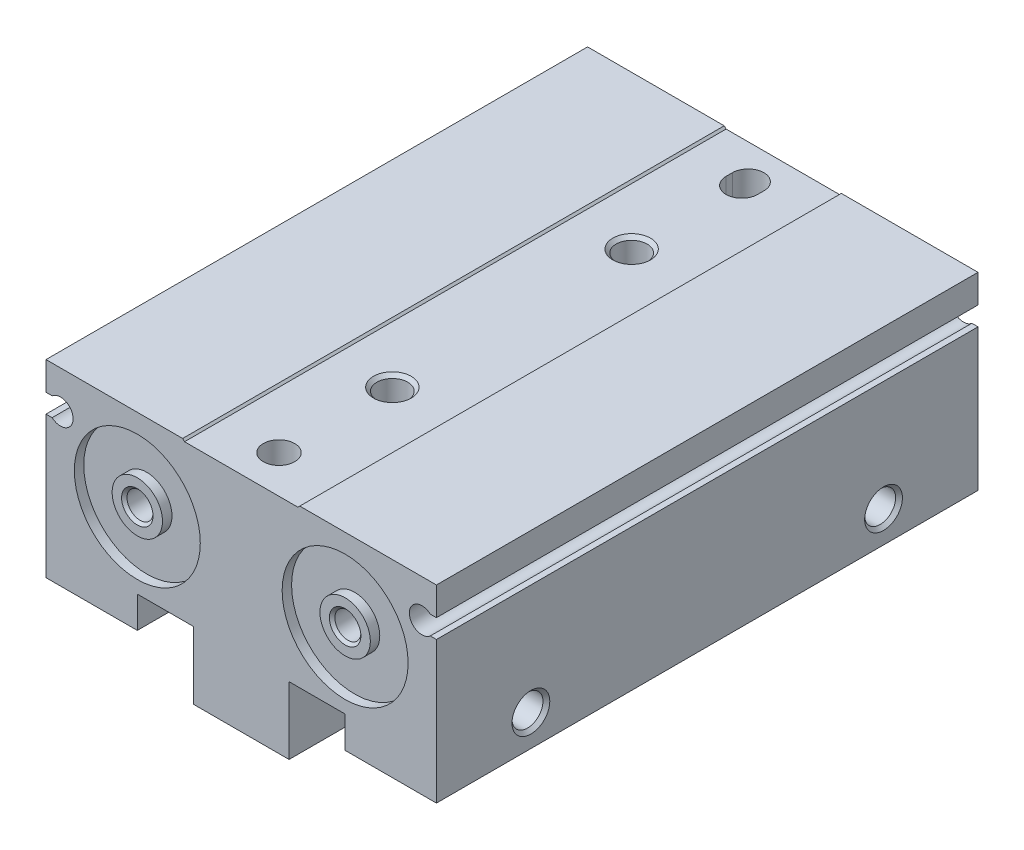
ISO-10303-21;
HEADER;
FILE_DESCRIPTION(('STEP AP214'),'2;1');
FILE_NAME('part.step','',(''),(''),'','','');
FILE_SCHEMA(('AUTOMOTIVE_DESIGN { 1 0 10303 214 1 1 1 1 }'));
ENDSEC;
DATA;
#1=APPLICATION_CONTEXT('core data for automotive mechanical design processes');
#2=APPLICATION_PROTOCOL_DEFINITION('international standard','automotive_design',2000,#1);
#3=PRODUCT_CONTEXT('',#1,'mechanical');
#4=PRODUCT('Part','Part','',(#3));
#5=PRODUCT_RELATED_PRODUCT_CATEGORY('part','',(#4));
#6=PRODUCT_DEFINITION_FORMATION('','',#4);
#7=PRODUCT_DEFINITION_CONTEXT('part definition',#1,'design');
#8=PRODUCT_DEFINITION('design','',#6,#7);
#9=PRODUCT_DEFINITION_SHAPE('','',#8);
#10=(LENGTH_UNIT() NAMED_UNIT(*) SI_UNIT(.MILLI.,.METRE.));
#11=(NAMED_UNIT(*) PLANE_ANGLE_UNIT() SI_UNIT($,.RADIAN.));
#12=(NAMED_UNIT(*) SI_UNIT($,.STERADIAN.) SOLID_ANGLE_UNIT());
#13=UNCERTAINTY_MEASURE_WITH_UNIT(LENGTH_MEASURE(1.E-05),#10,'distance_accuracy_value','');
#14=(GEOMETRIC_REPRESENTATION_CONTEXT(3) GLOBAL_UNCERTAINTY_ASSIGNED_CONTEXT((#13)) GLOBAL_UNIT_ASSIGNED_CONTEXT((#10,
#11,#12)) REPRESENTATION_CONTEXT('',''));
#15=CARTESIAN_POINT('',(0.,0.,0.));
#16=DIRECTION('',(0.,0.,1.));
#17=DIRECTION('',(1.,0.,0.));
#18=AXIS2_PLACEMENT_3D('',#15,#16,#17);
#19=CARTESIAN_POINT('',(7.6,-25.,-9.));
#20=DIRECTION('',(0.,-1.,0.));
#21=DIRECTION('',(1.,0.,0.));
#22=AXIS2_PLACEMENT_3D('',#19,#20,#21);
#23=PLANE('',#22);
#24=DIRECTION('',(1.,0.,0.));
#25=VECTOR('',#24,1.);
#26=CARTESIAN_POINT('',(7.6,-25.,-9.));
#27=LINE('',#26,#25);
#28=CARTESIAN_POINT('',(7.6,-25.,-9.));
#29=VERTEX_POINT('',#28);
#30=CARTESIAN_POINT('',(16.5,-25.,-9.));
#31=VERTEX_POINT('',#30);
#32=EDGE_CURVE('E252',#29,#31,#27,.T.);
#33=ORIENTED_EDGE('',*,*,#32,.T.);
#34=DIRECTION('',(0.,0.,1.));
#35=VECTOR('',#34,1.);
#36=CARTESIAN_POINT('',(16.5,-25.,-9.));
#37=LINE('',#36,#35);
#38=CARTESIAN_POINT('',(16.5,-25.,43.));
#39=VERTEX_POINT('',#38);
#40=EDGE_CURVE('E265',#39,#31,#37,.F.);
#41=ORIENTED_EDGE('',*,*,#40,.F.);
#42=DIRECTION('',(-1.,0.,0.));
#43=VECTOR('',#42,1.);
#44=CARTESIAN_POINT('',(16.5,-25.,43.));
#45=LINE('',#44,#43);
#46=CARTESIAN_POINT('',(7.6,-25.,43.));
#47=VERTEX_POINT('',#46);
#48=EDGE_CURVE('E273',#47,#39,#45,.F.);
#49=ORIENTED_EDGE('',*,*,#48,.F.);
#50=DIRECTION('',(0.,0.,-1.));
#51=VECTOR('',#50,1.);
#52=CARTESIAN_POINT('',(7.6,-25.,43.));
#53=LINE('',#52,#51);
#54=EDGE_CURVE('E267',#47,#29,#53,.T.);
#55=ORIENTED_EDGE('',*,*,#54,.T.);
#56=EDGE_LOOP('',(#33,#41,#49,#55));
#57=FACE_BOUND('',#56,.T.);
#58=ADVANCED_FACE('F17',(#57),#23,.T.);
#59=CARTESIAN_POINT('',(7.6,-25.,-43.));
#60=DIRECTION('',(0.,-1.,0.));
#61=DIRECTION('',(1.,0.,0.));
#62=AXIS2_PLACEMENT_3D('',#59,#60,#61);
#63=PLANE('',#62);
#64=DIRECTION('',(-1.,0.,0.));
#65=VECTOR('',#64,1.);
#66=CARTESIAN_POINT('',(16.5,-25.,-20.));
#67=LINE('',#66,#65);
#68=CARTESIAN_POINT('',(16.5,-25.,-20.));
#69=VERTEX_POINT('',#68);
#70=CARTESIAN_POINT('',(7.6,-25.,-20.));
#71=VERTEX_POINT('',#70);
#72=EDGE_CURVE('E284',#69,#71,#67,.T.);
#73=ORIENTED_EDGE('',*,*,#72,.T.);
#74=DIRECTION('',(0.,0.,-1.));
#75=VECTOR('',#74,1.);
#76=CARTESIAN_POINT('',(7.6,-25.,-20.));
#77=LINE('',#76,#75);
#78=CARTESIAN_POINT('',(7.6,-25.,-43.));
#79=VERTEX_POINT('',#78);
#80=EDGE_CURVE('E289',#71,#79,#77,.T.);
#81=ORIENTED_EDGE('',*,*,#80,.T.);
#82=DIRECTION('',(1.,0.,0.));
#83=VECTOR('',#82,1.);
#84=CARTESIAN_POINT('',(7.6,-25.,-43.));
#85=LINE('',#84,#83);
#86=CARTESIAN_POINT('',(16.5,-25.,-43.));
#87=VERTEX_POINT('',#86);
#88=EDGE_CURVE('E294',#79,#87,#85,.T.);
#89=ORIENTED_EDGE('',*,*,#88,.T.);
#90=DIRECTION('',(0.,0.,1.));
#91=VECTOR('',#90,1.);
#92=CARTESIAN_POINT('',(16.5,-25.,-43.));
#93=LINE('',#92,#91);
#94=EDGE_CURVE('E299',#69,#87,#93,.F.);
#95=ORIENTED_EDGE('',*,*,#94,.F.);
#96=EDGE_LOOP('',(#73,#81,#89,#95));
#97=FACE_BOUND('',#96,.T.);
#98=ADVANCED_FACE('F949',(#97),#63,.T.);
#99=CARTESIAN_POINT('',(-16.5,-25.,20.));
#100=DIRECTION('',(0.,-1.,0.));
#101=DIRECTION('',(1.,0.,0.));
#102=AXIS2_PLACEMENT_3D('',#99,#100,#101);
#103=PLANE('',#102);
#104=DIRECTION('',(1.,0.,0.));
#105=VECTOR('',#104,1.);
#106=CARTESIAN_POINT('',(-16.5,-25.,20.));
#107=LINE('',#106,#105);
#108=CARTESIAN_POINT('',(-16.5,-25.,20.));
#109=VERTEX_POINT('',#108);
#110=CARTESIAN_POINT('',(-7.6,-25.,20.));
#111=VERTEX_POINT('',#110);
#112=EDGE_CURVE('E304',#109,#111,#107,.T.);
#113=ORIENTED_EDGE('',*,*,#112,.T.);
#114=DIRECTION('',(0.,0.,1.));
#115=VECTOR('',#114,1.);
#116=CARTESIAN_POINT('',(-7.6,-25.,20.));
#117=LINE('',#116,#115);
#118=CARTESIAN_POINT('',(-7.6,-25.,43.));
#119=VERTEX_POINT('',#118);
#120=EDGE_CURVE('E309',#119,#111,#117,.F.);
#121=ORIENTED_EDGE('',*,*,#120,.F.);
#122=DIRECTION('',(-1.,0.,0.));
#123=VECTOR('',#122,1.);
#124=CARTESIAN_POINT('',(-7.6,-25.,43.));
#125=LINE('',#124,#123);
#126=CARTESIAN_POINT('',(-16.5,-25.,43.));
#127=VERTEX_POINT('',#126);
#128=EDGE_CURVE('E314',#127,#119,#125,.F.);
#129=ORIENTED_EDGE('',*,*,#128,.F.);
#130=DIRECTION('',(0.,0.,-1.));
#131=VECTOR('',#130,1.);
#132=CARTESIAN_POINT('',(-16.5,-25.,43.));
#133=LINE('',#132,#131);
#134=EDGE_CURVE('E318',#127,#109,#133,.T.);
#135=ORIENTED_EDGE('',*,*,#134,.T.);
#136=EDGE_LOOP('',(#113,#121,#129,#135));
#137=FACE_BOUND('',#136,.T.);
#138=ADVANCED_FACE('F954',(#137),#103,.T.);
#139=CARTESIAN_POINT('',(-16.5,-25.,-43.));
#140=DIRECTION('',(0.,-1.,0.));
#141=DIRECTION('',(1.,0.,0.));
#142=AXIS2_PLACEMENT_3D('',#139,#140,#141);
#143=PLANE('',#142);
#144=DIRECTION('',(-1.,0.,0.));
#145=VECTOR('',#144,1.);
#146=CARTESIAN_POINT('',(-7.6,-25.,9.));
#147=LINE('',#146,#145);
#148=CARTESIAN_POINT('',(-7.6,-25.,9.));
#149=VERTEX_POINT('',#148);
#150=CARTESIAN_POINT('',(-16.5,-25.,9.));
#151=VERTEX_POINT('',#150);
#152=EDGE_CURVE('E323',#149,#151,#147,.T.);
#153=ORIENTED_EDGE('',*,*,#152,.T.);
#154=DIRECTION('',(0.,0.,-1.));
#155=VECTOR('',#154,1.);
#156=CARTESIAN_POINT('',(-16.5,-25.,9.));
#157=LINE('',#156,#155);
#158=CARTESIAN_POINT('',(-16.5,-25.,-43.));
#159=VERTEX_POINT('',#158);
#160=EDGE_CURVE('E328',#151,#159,#157,.T.);
#161=ORIENTED_EDGE('',*,*,#160,.T.);
#162=DIRECTION('',(1.,0.,0.));
#163=VECTOR('',#162,1.);
#164=CARTESIAN_POINT('',(-16.5,-25.,-43.));
#165=LINE('',#164,#163);
#166=CARTESIAN_POINT('',(-7.6,-25.,-43.));
#167=VERTEX_POINT('',#166);
#168=EDGE_CURVE('E333',#159,#167,#165,.T.);
#169=ORIENTED_EDGE('',*,*,#168,.T.);
#170=DIRECTION('',(0.,0.,1.));
#171=VECTOR('',#170,1.);
#172=CARTESIAN_POINT('',(-7.6,-25.,-43.));
#173=LINE('',#172,#171);
#174=EDGE_CURVE('E338',#149,#167,#173,.F.);
#175=ORIENTED_EDGE('',*,*,#174,.F.);
#176=EDGE_LOOP('',(#153,#161,#169,#175));
#177=FACE_BOUND('',#176,.T.);
#178=ADVANCED_FACE('F960',(#177),#143,.T.);
#179=CARTESIAN_POINT('',(-31.,-7.5,43.));
#180=DIRECTION('',(0.,1.,0.));
#181=DIRECTION('',(1.,0.,0.));
#182=AXIS2_PLACEMENT_3D('',#179,#180,#181);
#183=PLANE('',#182);
#184=DIRECTION('',(-1.,0.,0.));
#185=VECTOR('',#184,1.);
#186=CARTESIAN_POINT('',(-30.022875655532,-7.5,-43.));
#187=LINE('',#186,#185);
#188=CARTESIAN_POINT('',(-30.022875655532,-7.5,-43.));
#189=VERTEX_POINT('',#188);
#190=CARTESIAN_POINT('',(-31.,-7.5,-43.));
#191=VERTEX_POINT('',#190);
#192=EDGE_CURVE('E343',#189,#191,#187,.T.);
#193=ORIENTED_EDGE('',*,*,#192,.T.);
#194=DIRECTION('',(0.,0.,1.));
#195=VECTOR('',#194,1.);
#196=CARTESIAN_POINT('',(-31.,-7.5,-43.));
#197=LINE('',#196,#195);
#198=CARTESIAN_POINT('',(-31.,-7.5,43.));
#199=VERTEX_POINT('',#198);
#200=EDGE_CURVE('E348',#199,#191,#197,.F.);
#201=ORIENTED_EDGE('',*,*,#200,.F.);
#202=DIRECTION('',(1.,0.,0.));
#203=VECTOR('',#202,1.);
#204=CARTESIAN_POINT('',(-31.,-7.5,43.));
#205=LINE('',#204,#203);
#206=CARTESIAN_POINT('',(-30.022875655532,-7.5,43.));
#207=VERTEX_POINT('',#206);
#208=EDGE_CURVE('E353',#207,#199,#205,.F.);
#209=ORIENTED_EDGE('',*,*,#208,.F.);
#210=DIRECTION('',(0.,0.,-1.));
#211=VECTOR('',#210,1.);
#212=CARTESIAN_POINT('',(-30.022875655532,-7.5,43.));
#213=LINE('',#212,#211);
#214=EDGE_CURVE('E357',#207,#189,#213,.T.);
#215=ORIENTED_EDGE('',*,*,#214,.T.);
#216=EDGE_LOOP('',(#193,#201,#209,#215));
#217=FACE_BOUND('',#216,.T.);
#218=ADVANCED_FACE('F964',(#217),#183,.T.);
#219=CARTESIAN_POINT('',(-31.,-30.,43.));
#220=DIRECTION('',(-1.,0.,0.));
#221=DIRECTION('',(0.,1.,0.));
#222=AXIS2_PLACEMENT_3D('',#219,#220,#221);
#223=PLANE('',#222);
#224=DIRECTION('',(0.,-1.,0.));
#225=VECTOR('',#224,1.);
#226=CARTESIAN_POINT('',(-31.,-7.5,-43.));
#227=LINE('',#226,#225);
#228=CARTESIAN_POINT('',(-31.,-30.,-43.));
#229=VERTEX_POINT('',#228);
#230=EDGE_CURVE('E362',#191,#229,#227,.T.);
#231=ORIENTED_EDGE('',*,*,#230,.T.);
#232=DIRECTION('',(0.,0.,1.));
#233=VECTOR('',#232,1.);
#234=CARTESIAN_POINT('',(-31.,-30.,-43.));
#235=LINE('',#234,#233);
#236=CARTESIAN_POINT('',(-31.,-30.,43.));
#237=VERTEX_POINT('',#236);
#238=EDGE_CURVE('E367',#237,#229,#235,.F.);
#239=ORIENTED_EDGE('',*,*,#238,.F.);
#240=DIRECTION('',(0.,1.,0.));
#241=VECTOR('',#240,1.);
#242=CARTESIAN_POINT('',(-31.,-30.,43.));
#243=LINE('',#242,#241);
#244=EDGE_CURVE('E372',#199,#237,#243,.F.);
#245=ORIENTED_EDGE('',*,*,#244,.F.);
#246=ORIENTED_EDGE('',*,*,#200,.T.);
#247=EDGE_LOOP('',(#231,#239,#245,#246));
#248=FACE_BOUND('',#247,.T.);
#249=CARTESIAN_POINT('',(-31.,-25.,-28.));
#250=DIRECTION('',(1.,0.,0.));
#251=DIRECTION('',(0.,0.,1.));
#252=AXIS2_PLACEMENT_3D('',#249,#250,#251);
#253=CIRCLE('',#252,3.);
#254=CARTESIAN_POINT('',(-31.,-25.,-25.));
#255=VERTEX_POINT('',#254);
#256=EDGE_CURVE('E376',#255,#255,#253,.F.);
#257=ORIENTED_EDGE('',*,*,#256,.F.);
#258=EDGE_LOOP('',(#257));
#259=FACE_BOUND('',#258,.T.);
#260=CARTESIAN_POINT('',(-31.,-25.,28.));
#261=DIRECTION('',(1.,0.,0.));
#262=DIRECTION('',(0.,0.,1.));
#263=AXIS2_PLACEMENT_3D('',#260,#261,#262);
#264=CIRCLE('',#263,3.);
#265=CARTESIAN_POINT('',(-31.,-25.,31.));
#266=VERTEX_POINT('',#265);
#267=EDGE_CURVE('E381',#266,#266,#264,.F.);
#268=ORIENTED_EDGE('',*,*,#267,.F.);
#269=EDGE_LOOP('',(#268));
#270=FACE_BOUND('',#269,.T.);
#271=ADVANCED_FACE('F968',(#248,#259,#270),#223,.T.);
#272=CARTESIAN_POINT('',(-31.,-30.,-43.));
#273=DIRECTION('',(0.,-1.,0.));
#274=DIRECTION('',(1.,0.,0.));
#275=AXIS2_PLACEMENT_3D('',#272,#273,#274);
#276=PLANE('',#275);
#277=DIRECTION('',(1.,0.,0.));
#278=VECTOR('',#277,1.);
#279=CARTESIAN_POINT('',(-31.,-30.,-43.));
#280=LINE('',#279,#278);
#281=CARTESIAN_POINT('',(-16.5,-30.,-43.));
#282=VERTEX_POINT('',#281);
#283=EDGE_CURVE('E384',#229,#282,#280,.T.);
#284=ORIENTED_EDGE('',*,*,#283,.T.);
#285=DIRECTION('',(0.,0.,1.));
#286=VECTOR('',#285,1.);
#287=CARTESIAN_POINT('',(-16.5,-30.,-43.));
#288=LINE('',#287,#286);
#289=CARTESIAN_POINT('',(-16.5,-30.,43.));
#290=VERTEX_POINT('',#289);
#291=EDGE_CURVE('E387',#290,#282,#288,.F.);
#292=ORIENTED_EDGE('',*,*,#291,.F.);
#293=DIRECTION('',(-1.,0.,0.));
#294=VECTOR('',#293,1.);
#295=CARTESIAN_POINT('',(-16.5,-30.,43.));
#296=LINE('',#295,#294);
#297=EDGE_CURVE('E392',#237,#290,#296,.F.);
#298=ORIENTED_EDGE('',*,*,#297,.F.);
#299=ORIENTED_EDGE('',*,*,#238,.T.);
#300=EDGE_LOOP('',(#284,#292,#298,#299));
#301=FACE_BOUND('',#300,.T.);
#302=CARTESIAN_POINT('',(-26.,-30.,20.));
#303=DIRECTION('',(0.,1.,0.));
#304=DIRECTION('',(0.,0.,-1.));
#305=AXIS2_PLACEMENT_3D('',#302,#303,#304);
#306=CIRCLE('',#305,3.);
#307=CARTESIAN_POINT('',(-26.,-30.,17.));
#308=VERTEX_POINT('',#307);
#309=EDGE_CURVE('E396',#308,#308,#306,.T.);
#310=ORIENTED_EDGE('',*,*,#309,.T.);
#311=EDGE_LOOP('',(#310));
#312=FACE_BOUND('',#311,.T.);
#313=CARTESIAN_POINT('',(-26.,-30.,-20.));
#314=DIRECTION('',(0.,1.,0.));
#315=DIRECTION('',(0.,0.,-1.));
#316=AXIS2_PLACEMENT_3D('',#313,#314,#315);
#317=CIRCLE('',#316,3.);
#318=CARTESIAN_POINT('',(-26.,-30.,-23.));
#319=VERTEX_POINT('',#318);
#320=EDGE_CURVE('E401',#319,#319,#317,.T.);
#321=ORIENTED_EDGE('',*,*,#320,.T.);
#322=EDGE_LOOP('',(#321));
#323=FACE_BOUND('',#322,.T.);
#324=ADVANCED_FACE('F972',(#301,#312,#323),#276,.T.);
#325=CARTESIAN_POINT('',(-16.5,-30.,-43.));
#326=DIRECTION('',(1.,0.,0.));
#327=DIRECTION('',(0.,1.,0.));
#328=AXIS2_PLACEMENT_3D('',#325,#326,#327);
#329=PLANE('',#328);
#330=DIRECTION('',(0.,1.,0.));
#331=VECTOR('',#330,1.);
#332=CARTESIAN_POINT('',(-16.5,-30.,-43.));
#333=LINE('',#332,#331);
#334=EDGE_CURVE('E404',#282,#159,#333,.T.);
#335=ORIENTED_EDGE('',*,*,#334,.T.);
#336=ORIENTED_EDGE('',*,*,#160,.F.);
#337=DIRECTION('',(0.,1.,0.));
#338=VECTOR('',#337,1.);
#339=CARTESIAN_POINT('',(-16.5,-25.,9.00000000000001));
#340=LINE('',#339,#338);
#341=CARTESIAN_POINT('',(-16.5,-23.4,9.00000000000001));
#342=VERTEX_POINT('',#341);
#343=EDGE_CURVE('E407',#342,#151,#340,.F.);
#344=ORIENTED_EDGE('',*,*,#343,.F.);
#345=DIRECTION('',(0.,0.,1.));
#346=VECTOR('',#345,1.);
#347=CARTESIAN_POINT('',(-16.5,-23.4,9.00000000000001));
#348=LINE('',#347,#346);
#349=CARTESIAN_POINT('',(-16.5,-23.4,20.));
#350=VERTEX_POINT('',#349);
#351=EDGE_CURVE('E411',#342,#350,#348,.T.);
#352=ORIENTED_EDGE('',*,*,#351,.T.);
#353=DIRECTION('',(0.,-1.,0.));
#354=VECTOR('',#353,1.);
#355=CARTESIAN_POINT('',(-16.5,-23.4,20.));
#356=LINE('',#355,#354);
#357=EDGE_CURVE('E416',#350,#109,#356,.T.);
#358=ORIENTED_EDGE('',*,*,#357,.T.);
#359=ORIENTED_EDGE('',*,*,#134,.F.);
#360=DIRECTION('',(0.,-1.,0.));
#361=VECTOR('',#360,1.);
#362=CARTESIAN_POINT('',(-16.5,-25.,43.));
#363=LINE('',#362,#361);
#364=EDGE_CURVE('E421',#290,#127,#363,.F.);
#365=ORIENTED_EDGE('',*,*,#364,.F.);
#366=ORIENTED_EDGE('',*,*,#291,.T.);
#367=EDGE_LOOP('',(#335,#336,#344,#352,#358,#359,#365,#366));
#368=FACE_BOUND('',#367,.T.);
#369=ADVANCED_FACE('F976',(#368),#329,.T.);
#370=CARTESIAN_POINT('',(-7.6,-35.7,43.));
#371=DIRECTION('',(-1.,0.,0.));
#372=DIRECTION('',(0.,1.,0.));
#373=AXIS2_PLACEMENT_3D('',#370,#371,#372);
#374=PLANE('',#373);
#375=DIRECTION('',(0.,-1.,0.));
#376=VECTOR('',#375,1.);
#377=CARTESIAN_POINT('',(-7.6,-25.,-43.));
#378=LINE('',#377,#376);
#379=CARTESIAN_POINT('',(-7.6,-35.7,-43.));
#380=VERTEX_POINT('',#379);
#381=EDGE_CURVE('E425',#167,#380,#378,.T.);
#382=ORIENTED_EDGE('',*,*,#381,.T.);
#383=DIRECTION('',(0.,0.,1.));
#384=VECTOR('',#383,1.);
#385=CARTESIAN_POINT('',(-7.6,-35.7,-43.));
#386=LINE('',#385,#384);
#387=CARTESIAN_POINT('',(-7.6,-35.7,43.));
#388=VERTEX_POINT('',#387);
#389=EDGE_CURVE('E430',#388,#380,#386,.F.);
#390=ORIENTED_EDGE('',*,*,#389,.F.);
#391=DIRECTION('',(0.,1.,0.));
#392=VECTOR('',#391,1.);
#393=CARTESIAN_POINT('',(-7.6,-35.7,43.));
#394=LINE('',#393,#392);
#395=EDGE_CURVE('E435',#119,#388,#394,.F.);
#396=ORIENTED_EDGE('',*,*,#395,.F.);
#397=ORIENTED_EDGE('',*,*,#120,.T.);
#398=DIRECTION('',(0.,1.,0.));
#399=VECTOR('',#398,1.);
#400=CARTESIAN_POINT('',(-7.6,-25.,20.));
#401=LINE('',#400,#399);
#402=CARTESIAN_POINT('',(-7.6,-23.4,20.));
#403=VERTEX_POINT('',#402);
#404=EDGE_CURVE('E439',#403,#111,#401,.F.);
#405=ORIENTED_EDGE('',*,*,#404,.F.);
#406=DIRECTION('',(0.,0.,-1.));
#407=VECTOR('',#406,1.);
#408=CARTESIAN_POINT('',(-7.6,-23.4,20.));
#409=LINE('',#408,#407);
#410=CARTESIAN_POINT('',(-7.6,-23.4,9.));
#411=VERTEX_POINT('',#410);
#412=EDGE_CURVE('E443',#403,#411,#409,.T.);
#413=ORIENTED_EDGE('',*,*,#412,.T.);
#414=DIRECTION('',(0.,-1.,0.));
#415=VECTOR('',#414,1.);
#416=CARTESIAN_POINT('',(-7.6,-23.4,9.));
#417=LINE('',#416,#415);
#418=EDGE_CURVE('E448',#411,#149,#417,.T.);
#419=ORIENTED_EDGE('',*,*,#418,.T.);
#420=ORIENTED_EDGE('',*,*,#174,.T.);
#421=EDGE_LOOP('',(#382,#390,#396,#397,#405,#413,#419,#420));
#422=FACE_BOUND('',#421,.T.);
#423=ADVANCED_FACE('F980',(#422),#374,.T.);
#424=CARTESIAN_POINT('',(-7.6,-35.7,-43.));
#425=DIRECTION('',(0.,-1.,0.));
#426=DIRECTION('',(1.,0.,0.));
#427=AXIS2_PLACEMENT_3D('',#424,#425,#426);
#428=PLANE('',#427);
#429=DIRECTION('',(1.,0.,0.));
#430=VECTOR('',#429,1.);
#431=CARTESIAN_POINT('',(-7.6,-35.7,-43.));
#432=LINE('',#431,#430);
#433=CARTESIAN_POINT('',(7.6,-35.7,-43.));
#434=VERTEX_POINT('',#433);
#435=EDGE_CURVE('E453',#380,#434,#432,.T.);
#436=ORIENTED_EDGE('',*,*,#435,.T.);
#437=DIRECTION('',(0.,0.,1.));
#438=VECTOR('',#437,1.);
#439=CARTESIAN_POINT('',(7.6,-35.7,-43.));
#440=LINE('',#439,#438);
#441=CARTESIAN_POINT('',(7.6,-35.7,43.));
#442=VERTEX_POINT('',#441);
#443=EDGE_CURVE('E458',#442,#434,#440,.F.);
#444=ORIENTED_EDGE('',*,*,#443,.F.);
#445=DIRECTION('',(-1.,0.,0.));
#446=VECTOR('',#445,1.);
#447=CARTESIAN_POINT('',(7.6,-35.7,43.));
#448=LINE('',#447,#446);
#449=EDGE_CURVE('E463',#388,#442,#448,.F.);
#450=ORIENTED_EDGE('',*,*,#449,.F.);
#451=ORIENTED_EDGE('',*,*,#389,.T.);
#452=EDGE_LOOP('',(#436,#444,#450,#451));
#453=FACE_BOUND('',#452,.T.);
#454=CARTESIAN_POINT('',(0.,-35.7,-19.));
#455=DIRECTION('',(0.,1.,0.));
#456=DIRECTION('',(0.,0.,-1.));
#457=AXIS2_PLACEMENT_3D('',#454,#455,#456);
#458=CIRCLE('',#457,5.);
#459=CARTESIAN_POINT('',(0.,-35.7,-24.));
#460=VERTEX_POINT('',#459);
#461=EDGE_CURVE('E467',#460,#460,#458,.F.);
#462=ORIENTED_EDGE('',*,*,#461,.F.);
#463=EDGE_LOOP('',(#462));
#464=FACE_BOUND('',#463,.T.);
#465=CARTESIAN_POINT('',(0.,-35.7,19.));
#466=DIRECTION('',(0.,1.,0.));
#467=DIRECTION('',(0.,0.,-1.));
#468=AXIS2_PLACEMENT_3D('',#465,#466,#467);
#469=CIRCLE('',#468,5.);
#470=CARTESIAN_POINT('',(0.,-35.7,14.));
#471=VERTEX_POINT('',#470);
#472=EDGE_CURVE('E472',#471,#471,#469,.F.);
#473=ORIENTED_EDGE('',*,*,#472,.F.);
#474=EDGE_LOOP('',(#473));
#475=FACE_BOUND('',#474,.T.);
#476=ADVANCED_FACE('F984',(#453,#464,#475),#428,.T.);
#477=CARTESIAN_POINT('',(7.6,-35.7,-43.));
#478=DIRECTION('',(1.,0.,0.));
#479=DIRECTION('',(0.,1.,0.));
#480=AXIS2_PLACEMENT_3D('',#477,#478,#479);
#481=PLANE('',#480);
#482=DIRECTION('',(0.,1.,0.));
#483=VECTOR('',#482,1.);
#484=CARTESIAN_POINT('',(7.6,-35.7,-43.));
#485=LINE('',#484,#483);
#486=EDGE_CURVE('E475',#434,#79,#485,.T.);
#487=ORIENTED_EDGE('',*,*,#486,.T.);
#488=ORIENTED_EDGE('',*,*,#80,.F.);
#489=DIRECTION('',(0.,1.,0.));
#490=VECTOR('',#489,1.);
#491=CARTESIAN_POINT('',(7.6,-25.,-20.));
#492=LINE('',#491,#490);
#493=CARTESIAN_POINT('',(7.6,-23.4,-20.));
#494=VERTEX_POINT('',#493);
#495=EDGE_CURVE('E478',#494,#71,#492,.F.);
#496=ORIENTED_EDGE('',*,*,#495,.F.);
#497=DIRECTION('',(0.,0.,1.));
#498=VECTOR('',#497,1.);
#499=CARTESIAN_POINT('',(7.6,-23.4,-20.));
#500=LINE('',#499,#498);
#501=CARTESIAN_POINT('',(7.6,-23.4,-9.));
#502=VERTEX_POINT('',#501);
#503=EDGE_CURVE('E482',#494,#502,#500,.T.);
#504=ORIENTED_EDGE('',*,*,#503,.T.);
#505=DIRECTION('',(0.,-1.,0.));
#506=VECTOR('',#505,1.);
#507=CARTESIAN_POINT('',(7.6,-23.4,-9.));
#508=LINE('',#507,#506);
#509=EDGE_CURVE('E487',#502,#29,#508,.T.);
#510=ORIENTED_EDGE('',*,*,#509,.T.);
#511=ORIENTED_EDGE('',*,*,#54,.F.);
#512=DIRECTION('',(0.,-1.,0.));
#513=VECTOR('',#512,1.);
#514=CARTESIAN_POINT('',(7.6,-25.,43.));
#515=LINE('',#514,#513);
#516=EDGE_CURVE('E491',#442,#47,#515,.F.);
#517=ORIENTED_EDGE('',*,*,#516,.F.);
#518=ORIENTED_EDGE('',*,*,#443,.T.);
#519=EDGE_LOOP('',(#487,#488,#496,#504,#510,#511,#517,#518));
#520=FACE_BOUND('',#519,.T.);
#521=ADVANCED_FACE('F988',(#520),#481,.T.);
#522=CARTESIAN_POINT('',(16.5,-30.,43.));
#523=DIRECTION('',(-1.,0.,0.));
#524=DIRECTION('',(0.,1.,0.));
#525=AXIS2_PLACEMENT_3D('',#522,#523,#524);
#526=PLANE('',#525);
#527=DIRECTION('',(0.,-1.,0.));
#528=VECTOR('',#527,1.);
#529=CARTESIAN_POINT('',(16.5,-25.,-43.));
#530=LINE('',#529,#528);
#531=CARTESIAN_POINT('',(16.5,-30.,-43.));
#532=VERTEX_POINT('',#531);
#533=EDGE_CURVE('E495',#87,#532,#530,.T.);
#534=ORIENTED_EDGE('',*,*,#533,.T.);
#535=DIRECTION('',(0.,0.,1.));
#536=VECTOR('',#535,1.);
#537=CARTESIAN_POINT('',(16.5,-30.,-43.));
#538=LINE('',#537,#536);
#539=CARTESIAN_POINT('',(16.5,-30.,43.));
#540=VERTEX_POINT('',#539);
#541=EDGE_CURVE('E499',#540,#532,#538,.F.);
#542=ORIENTED_EDGE('',*,*,#541,.F.);
#543=DIRECTION('',(0.,1.,0.));
#544=VECTOR('',#543,1.);
#545=CARTESIAN_POINT('',(16.5,-30.,43.));
#546=LINE('',#545,#544);
#547=EDGE_CURVE('E259',#39,#540,#546,.F.);
#548=ORIENTED_EDGE('',*,*,#547,.F.);
#549=ORIENTED_EDGE('',*,*,#40,.T.);
#550=DIRECTION('',(0.,1.,0.));
#551=VECTOR('',#550,1.);
#552=CARTESIAN_POINT('',(16.5,-25.,-9.));
#553=LINE('',#552,#551);
#554=CARTESIAN_POINT('',(16.5,-23.4,-9.));
#555=VERTEX_POINT('',#554);
#556=EDGE_CURVE('E248',#555,#31,#553,.F.);
#557=ORIENTED_EDGE('',*,*,#556,.F.);
#558=DIRECTION('',(0.,0.,-1.));
#559=VECTOR('',#558,1.);
#560=CARTESIAN_POINT('',(16.5,-23.4,-9.));
#561=LINE('',#560,#559);
#562=CARTESIAN_POINT('',(16.5,-23.4,-20.));
#563=VERTEX_POINT('',#562);
#564=EDGE_CURVE('E258',#555,#563,#561,.T.);
#565=ORIENTED_EDGE('',*,*,#564,.T.);
#566=DIRECTION('',(0.,-1.,0.));
#567=VECTOR('',#566,1.);
#568=CARTESIAN_POINT('',(16.5,-23.4,-20.));
#569=LINE('',#568,#567);
#570=EDGE_CURVE('E512',#563,#69,#569,.T.);
#571=ORIENTED_EDGE('',*,*,#570,.T.);
#572=ORIENTED_EDGE('',*,*,#94,.T.);
#573=EDGE_LOOP('',(#534,#542,#548,#549,#557,#565,#571,#572));
#574=FACE_BOUND('',#573,.T.);
#575=ADVANCED_FACE('F271',(#574),#526,.T.);
#576=CARTESIAN_POINT('',(16.5,-30.,-43.));
#577=DIRECTION('',(0.,-1.,0.));
#578=DIRECTION('',(1.,0.,0.));
#579=AXIS2_PLACEMENT_3D('',#576,#577,#578);
#580=PLANE('',#579);
#581=DIRECTION('',(1.,0.,0.));
#582=VECTOR('',#581,1.);
#583=CARTESIAN_POINT('',(16.5,-30.,-43.));
#584=LINE('',#583,#582);
#585=CARTESIAN_POINT('',(31.,-30.,-43.));
#586=VERTEX_POINT('',#585);
#587=EDGE_CURVE('E517',#532,#586,#584,.T.);
#588=ORIENTED_EDGE('',*,*,#587,.T.);
#589=DIRECTION('',(0.,0.,1.));
#590=VECTOR('',#589,1.);
#591=CARTESIAN_POINT('',(31.,-30.,-43.));
#592=LINE('',#591,#590);
#593=CARTESIAN_POINT('',(31.,-30.,43.));
#594=VERTEX_POINT('',#593);
#595=EDGE_CURVE('E522',#594,#586,#592,.F.);
#596=ORIENTED_EDGE('',*,*,#595,.F.);
#597=DIRECTION('',(-1.,0.,0.));
#598=VECTOR('',#597,1.);
#599=CARTESIAN_POINT('',(31.,-30.,43.));
#600=LINE('',#599,#598);
#601=EDGE_CURVE('E527',#540,#594,#600,.F.);
#602=ORIENTED_EDGE('',*,*,#601,.F.);
#603=ORIENTED_EDGE('',*,*,#541,.T.);
#604=EDGE_LOOP('',(#588,#596,#602,#603));
#605=FACE_BOUND('',#604,.T.);
#606=CARTESIAN_POINT('',(26.,-30.,-20.));
#607=DIRECTION('',(0.,1.,0.));
#608=DIRECTION('',(0.,0.,-1.));
#609=AXIS2_PLACEMENT_3D('',#606,#607,#608);
#610=CIRCLE('',#609,3.);
#611=CARTESIAN_POINT('',(26.,-30.,-23.));
#612=VERTEX_POINT('',#611);
#613=EDGE_CURVE('E531',#612,#612,#610,.T.);
#614=ORIENTED_EDGE('',*,*,#613,.T.);
#615=EDGE_LOOP('',(#614));
#616=FACE_BOUND('',#615,.T.);
#617=CARTESIAN_POINT('',(26.,-30.,20.));
#618=DIRECTION('',(0.,1.,0.));
#619=DIRECTION('',(0.,0.,-1.));
#620=AXIS2_PLACEMENT_3D('',#617,#618,#619);
#621=CIRCLE('',#620,3.);
#622=CARTESIAN_POINT('',(26.,-30.,17.));
#623=VERTEX_POINT('',#622);
#624=EDGE_CURVE('E536',#623,#623,#621,.T.);
#625=ORIENTED_EDGE('',*,*,#624,.T.);
#626=EDGE_LOOP('',(#625));
#627=FACE_BOUND('',#626,.T.);
#628=ADVANCED_FACE('F995',(#605,#616,#627),#580,.T.);
#629=CARTESIAN_POINT('',(31.,-30.,-43.));
#630=DIRECTION('',(1.,0.,0.));
#631=DIRECTION('',(0.,1.,0.));
#632=AXIS2_PLACEMENT_3D('',#629,#630,#631);
#633=PLANE('',#632);
#634=DIRECTION('',(0.,1.,0.));
#635=VECTOR('',#634,1.);
#636=CARTESIAN_POINT('',(31.,-30.,-43.));
#637=LINE('',#636,#635);
#638=CARTESIAN_POINT('',(31.,-7.50000000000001,-43.));
#639=VERTEX_POINT('',#638);
#640=EDGE_CURVE('E539',#586,#639,#637,.T.);
#641=ORIENTED_EDGE('',*,*,#640,.T.);
#642=DIRECTION('',(0.,0.,1.));
#643=VECTOR('',#642,1.);
#644=CARTESIAN_POINT('',(31.,-7.5,-43.));
#645=LINE('',#644,#643);
#646=CARTESIAN_POINT('',(31.,-7.5,43.));
#647=VERTEX_POINT('',#646);
#648=EDGE_CURVE('E542',#647,#639,#645,.F.);
#649=ORIENTED_EDGE('',*,*,#648,.F.);
#650=DIRECTION('',(0.,-1.,0.));
#651=VECTOR('',#650,1.);
#652=CARTESIAN_POINT('',(31.,-7.5,43.));
#653=LINE('',#652,#651);
#654=EDGE_CURVE('E547',#594,#647,#653,.F.);
#655=ORIENTED_EDGE('',*,*,#654,.F.);
#656=ORIENTED_EDGE('',*,*,#595,.T.);
#657=EDGE_LOOP('',(#641,#649,#655,#656));
#658=FACE_BOUND('',#657,.T.);
#659=CARTESIAN_POINT('',(31.,-25.,-28.));
#660=DIRECTION('',(-1.,0.,0.));
#661=DIRECTION('',(0.,-1.42053860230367E-07,-0.99999999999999));
#662=AXIS2_PLACEMENT_3D('',#659,#660,#661);
#663=CIRCLE('',#662,3.);
#664=CARTESIAN_POINT('',(31.,-25.0000004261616,-31.));
#665=VERTEX_POINT('',#664);
#666=EDGE_CURVE('E551',#665,#665,#663,.T.);
#667=ORIENTED_EDGE('',*,*,#666,.T.);
#668=EDGE_LOOP('',(#667));
#669=FACE_BOUND('',#668,.T.);
#670=CARTESIAN_POINT('',(31.,-25.,28.));
#671=DIRECTION('',(-1.,0.,0.));
#672=DIRECTION('',(0.,0.,-1.));
#673=AXIS2_PLACEMENT_3D('',#670,#671,#672);
#674=CIRCLE('',#673,3.);
#675=CARTESIAN_POINT('',(31.,-25.,25.));
#676=VERTEX_POINT('',#675);
#677=EDGE_CURVE('E556',#676,#676,#674,.T.);
#678=ORIENTED_EDGE('',*,*,#677,.T.);
#679=EDGE_LOOP('',(#678));
#680=FACE_BOUND('',#679,.T.);
#681=ADVANCED_FACE('F998',(#658,#669,#680),#633,.T.);
#682=CARTESIAN_POINT('',(30.022875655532,-7.5,43.));
#683=DIRECTION('',(0.,1.,0.));
#684=DIRECTION('',(1.,0.,0.));
#685=AXIS2_PLACEMENT_3D('',#682,#683,#684);
#686=PLANE('',#685);
#687=DIRECTION('',(-1.,0.,0.));
#688=VECTOR('',#687,1.);
#689=CARTESIAN_POINT('',(31.,-7.5,-43.));
#690=LINE('',#689,#688);
#691=CARTESIAN_POINT('',(30.022875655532,-7.5,-43.));
#692=VERTEX_POINT('',#691);
#693=EDGE_CURVE('E559',#639,#692,#690,.T.);
#694=ORIENTED_EDGE('',*,*,#693,.T.);
#695=DIRECTION('',(0.,0.,1.));
#696=VECTOR('',#695,1.);
#697=CARTESIAN_POINT('',(30.022875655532,-7.5,-43.));
#698=LINE('',#697,#696);
#699=CARTESIAN_POINT('',(30.022875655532,-7.5,43.));
#700=VERTEX_POINT('',#699);
#701=EDGE_CURVE('E562',#700,#692,#698,.F.);
#702=ORIENTED_EDGE('',*,*,#701,.F.);
#703=DIRECTION('',(1.,0.,0.));
#704=VECTOR('',#703,1.);
#705=CARTESIAN_POINT('',(30.022875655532,-7.5,43.));
#706=LINE('',#705,#704);
#707=EDGE_CURVE('E567',#647,#700,#706,.F.);
#708=ORIENTED_EDGE('',*,*,#707,.F.);
#709=ORIENTED_EDGE('',*,*,#648,.T.);
#710=EDGE_LOOP('',(#694,#702,#708,#709));
#711=FACE_BOUND('',#710,.T.);
#712=ADVANCED_FACE('F1002',(#711),#686,.T.);
#713=CARTESIAN_POINT('',(28.7,-6.,43.));
#714=DIRECTION('',(0.,0.,-1.));
#715=DIRECTION('',(0.661437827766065,-0.750000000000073,0.));
#716=AXIS2_PLACEMENT_3D('',#713,#714,#715);
#717=CYLINDRICAL_SURFACE('',#716,1.99999999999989);
#718=ORIENTED_EDGE('',*,*,#701,.T.);
#719=CARTESIAN_POINT('',(28.7,-6.,-43.));
#720=DIRECTION('',(0.,0.,-1.));
#721=DIRECTION('',(0.661437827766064,-0.750000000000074,0.));
#722=AXIS2_PLACEMENT_3D('',#719,#720,#721);
#723=CIRCLE('',#722,1.99999999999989);
#724=CARTESIAN_POINT('',(30.0228756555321,-4.49999999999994,-43.));
#725=VERTEX_POINT('',#724);
#726=EDGE_CURVE('E571',#725,#692,#723,.F.);
#727=ORIENTED_EDGE('',*,*,#726,.F.);
#728=DIRECTION('',(0.,0.,1.));
#729=VECTOR('',#728,1.);
#730=CARTESIAN_POINT('',(30.0228756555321,-4.49999999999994,-43.));
#731=LINE('',#730,#729);
#732=CARTESIAN_POINT('',(30.0228756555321,-4.49999999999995,43.));
#733=VERTEX_POINT('',#732);
#734=EDGE_CURVE('E575',#733,#725,#731,.F.);
#735=ORIENTED_EDGE('',*,*,#734,.F.);
#736=CARTESIAN_POINT('',(28.7,-6.,43.));
#737=DIRECTION('',(0.,0.,1.));
#738=DIRECTION('',(0.661437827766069,0.750000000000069,0.));
#739=AXIS2_PLACEMENT_3D('',#736,#737,#738);
#740=CIRCLE('',#739,1.99999999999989);
#741=EDGE_CURVE('E580',#733,#700,#740,.T.);
#742=ORIENTED_EDGE('',*,*,#741,.T.);
#743=EDGE_LOOP('',(#718,#727,#735,#742));
#744=FACE_BOUND('',#743,.T.);
#745=ADVANCED_FACE('F1006',(#744),#717,.F.);
#746=CARTESIAN_POINT('',(30.022875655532,-4.5,-43.));
#747=DIRECTION('',(0.,-1.,0.));
#748=DIRECTION('',(1.,0.,0.));
#749=AXIS2_PLACEMENT_3D('',#746,#747,#748);
#750=PLANE('',#749);
#751=DIRECTION('',(1.,0.,0.));
#752=VECTOR('',#751,1.);
#753=CARTESIAN_POINT('',(30.022875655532,-4.5,-43.));
#754=LINE('',#753,#752);
#755=CARTESIAN_POINT('',(31.,-4.5,-43.));
#756=VERTEX_POINT('',#755);
#757=EDGE_CURVE('E585',#725,#756,#754,.T.);
#758=ORIENTED_EDGE('',*,*,#757,.T.);
#759=DIRECTION('',(0.,0.,1.));
#760=VECTOR('',#759,1.);
#761=CARTESIAN_POINT('',(31.,-4.5,-43.));
#762=LINE('',#761,#760);
#763=CARTESIAN_POINT('',(31.,-4.5,43.));
#764=VERTEX_POINT('',#763);
#765=EDGE_CURVE('E590',#764,#756,#762,.F.);
#766=ORIENTED_EDGE('',*,*,#765,.F.);
#767=DIRECTION('',(-1.,0.,0.));
#768=VECTOR('',#767,1.);
#769=CARTESIAN_POINT('',(31.,-4.5,43.));
#770=LINE('',#769,#768);
#771=EDGE_CURVE('E595',#733,#764,#770,.F.);
#772=ORIENTED_EDGE('',*,*,#771,.F.);
#773=ORIENTED_EDGE('',*,*,#734,.T.);
#774=EDGE_LOOP('',(#758,#766,#772,#773));
#775=FACE_BOUND('',#774,.T.);
#776=ADVANCED_FACE('F1010',(#775),#750,.T.);
#777=CARTESIAN_POINT('',(31.,-4.5,-43.));
#778=DIRECTION('',(1.,0.,0.));
#779=DIRECTION('',(0.,1.,0.));
#780=AXIS2_PLACEMENT_3D('',#777,#778,#779);
#781=PLANE('',#780);
#782=DIRECTION('',(0.,1.,0.));
#783=VECTOR('',#782,1.);
#784=CARTESIAN_POINT('',(31.,-4.5,-43.));
#785=LINE('',#784,#783);
#786=CARTESIAN_POINT('',(31.,0.,-43.));
#787=VERTEX_POINT('',#786);
#788=EDGE_CURVE('E599',#756,#787,#785,.T.);
#789=ORIENTED_EDGE('',*,*,#788,.T.);
#790=DIRECTION('',(0.,0.,1.));
#791=VECTOR('',#790,1.);
#792=CARTESIAN_POINT('',(31.,0.,-43.));
#793=LINE('',#792,#791);
#794=CARTESIAN_POINT('',(31.,0.,43.));
#795=VERTEX_POINT('',#794);
#796=EDGE_CURVE('E604',#795,#787,#793,.F.);
#797=ORIENTED_EDGE('',*,*,#796,.F.);
#798=DIRECTION('',(0.,-1.,0.));
#799=VECTOR('',#798,1.);
#800=CARTESIAN_POINT('',(31.,0.,43.));
#801=LINE('',#800,#799);
#802=EDGE_CURVE('E609',#764,#795,#801,.F.);
#803=ORIENTED_EDGE('',*,*,#802,.F.);
#804=ORIENTED_EDGE('',*,*,#765,.T.);
#805=EDGE_LOOP('',(#789,#797,#803,#804));
#806=FACE_BOUND('',#805,.T.);
#807=ADVANCED_FACE('F1014',(#806),#781,.T.);
#808=CARTESIAN_POINT('',(9.3,0.,43.));
#809=DIRECTION('',(0.,1.,0.));
#810=DIRECTION('',(1.,0.,0.));
#811=AXIS2_PLACEMENT_3D('',#808,#809,#810);
#812=PLANE('',#811);
#813=DIRECTION('',(-1.,0.,0.));
#814=VECTOR('',#813,1.);
#815=CARTESIAN_POINT('',(31.,0.,-43.));
#816=LINE('',#815,#814);
#817=CARTESIAN_POINT('',(9.3,0.,-43.));
#818=VERTEX_POINT('',#817);
#819=EDGE_CURVE('E613',#787,#818,#816,.T.);
#820=ORIENTED_EDGE('',*,*,#819,.T.);
#821=DIRECTION('',(0.,0.,1.));
#822=VECTOR('',#821,1.);
#823=CARTESIAN_POINT('',(9.3,0.,-43.));
#824=LINE('',#823,#822);
#825=CARTESIAN_POINT('',(9.3,0.,43.));
#826=VERTEX_POINT('',#825);
#827=EDGE_CURVE('E618',#826,#818,#824,.F.);
#828=ORIENTED_EDGE('',*,*,#827,.F.);
#829=DIRECTION('',(1.,0.,0.));
#830=VECTOR('',#829,1.);
#831=CARTESIAN_POINT('',(9.3,0.,43.));
#832=LINE('',#831,#830);
#833=EDGE_CURVE('E623',#795,#826,#832,.F.);
#834=ORIENTED_EDGE('',*,*,#833,.F.);
#835=ORIENTED_EDGE('',*,*,#796,.T.);
#836=EDGE_LOOP('',(#820,#828,#834,#835));
#837=FACE_BOUND('',#836,.T.);
#838=ADVANCED_FACE('F1018',(#837),#812,.T.);
#839=CARTESIAN_POINT('',(9.,-0.299999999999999,-43.));
#840=DIRECTION('',(-0.707106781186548,0.707106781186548,0.));
#841=DIRECTION('',(0.,0.,1.));
#842=AXIS2_PLACEMENT_3D('',#839,#840,#841);
#843=PLANE('',#842);
#844=DIRECTION('',(-0.707106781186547,-0.707106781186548,0.));
#845=VECTOR('',#844,1.);
#846=CARTESIAN_POINT('',(9.3,0.,-43.));
#847=LINE('',#846,#845);
#848=CARTESIAN_POINT('',(9.,-0.299999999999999,-43.));
#849=VERTEX_POINT('',#848);
#850=EDGE_CURVE('E627',#818,#849,#847,.T.);
#851=ORIENTED_EDGE('',*,*,#850,.T.);
#852=DIRECTION('',(0.,0.,1.));
#853=VECTOR('',#852,1.);
#854=CARTESIAN_POINT('',(9.,-0.299999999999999,-43.));
#855=LINE('',#854,#853);
#856=CARTESIAN_POINT('',(9.,-0.299999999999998,43.));
#857=VERTEX_POINT('',#856);
#858=EDGE_CURVE('E632',#857,#849,#855,.F.);
#859=ORIENTED_EDGE('',*,*,#858,.F.);
#860=DIRECTION('',(0.707106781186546,0.707106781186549,0.));
#861=VECTOR('',#860,1.);
#862=CARTESIAN_POINT('',(9.,-0.299999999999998,43.));
#863=LINE('',#862,#861);
#864=EDGE_CURVE('E637',#826,#857,#863,.F.);
#865=ORIENTED_EDGE('',*,*,#864,.F.);
#866=ORIENTED_EDGE('',*,*,#827,.T.);
#867=EDGE_LOOP('',(#851,#859,#865,#866));
#868=FACE_BOUND('',#867,.T.);
#869=ADVANCED_FACE('F1022',(#868),#843,.T.);
#870=CARTESIAN_POINT('',(-9.,-0.3,43.));
#871=DIRECTION('',(0.,1.,0.));
#872=DIRECTION('',(1.,0.,0.));
#873=AXIS2_PLACEMENT_3D('',#870,#871,#872);
#874=PLANE('',#873);
#875=DIRECTION('',(-1.,0.,0.));
#876=VECTOR('',#875,1.);
#877=CARTESIAN_POINT('',(9.,-0.3,-43.));
#878=LINE('',#877,#876);
#879=CARTESIAN_POINT('',(-9.,-0.3,-43.));
#880=VERTEX_POINT('',#879);
#881=EDGE_CURVE('E641',#849,#880,#878,.T.);
#882=ORIENTED_EDGE('',*,*,#881,.T.);
#883=DIRECTION('',(0.,0.,1.));
#884=VECTOR('',#883,1.);
#885=CARTESIAN_POINT('',(-9.,-0.3,-43.));
#886=LINE('',#885,#884);
#887=CARTESIAN_POINT('',(-9.,-0.3,43.));
#888=VERTEX_POINT('',#887);
#889=EDGE_CURVE('E646',#888,#880,#886,.F.);
#890=ORIENTED_EDGE('',*,*,#889,.F.);
#891=DIRECTION('',(1.,0.,0.));
#892=VECTOR('',#891,1.);
#893=CARTESIAN_POINT('',(-9.,-0.3,43.));
#894=LINE('',#893,#892);
#895=EDGE_CURVE('E651',#857,#888,#894,.F.);
#896=ORIENTED_EDGE('',*,*,#895,.F.);
#897=ORIENTED_EDGE('',*,*,#858,.T.);
#898=EDGE_LOOP('',(#882,#890,#896,#897));
#899=FACE_BOUND('',#898,.T.);
#900=CARTESIAN_POINT('',(0.,-0.3,-19.));
#901=DIRECTION('',(0.,-1.,0.));
#902=DIRECTION('',(-1.42053859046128E-07,0.,0.99999999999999));
#903=AXIS2_PLACEMENT_3D('',#900,#901,#902);
#904=CIRCLE('',#903,3.);
#905=CARTESIAN_POINT('',(-4.26161577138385E-07,-0.3,-16.));
#906=VERTEX_POINT('',#905);
#907=EDGE_CURVE('E655',#906,#906,#904,.T.);
#908=ORIENTED_EDGE('',*,*,#907,.T.);
#909=EDGE_LOOP('',(#908));
#910=FACE_BOUND('',#909,.T.);
#911=CARTESIAN_POINT('',(0.,-0.3,19.));
#912=DIRECTION('',(0.,-1.,0.));
#913=DIRECTION('',(0.,0.,1.));
#914=AXIS2_PLACEMENT_3D('',#911,#912,#913);
#915=CIRCLE('',#914,3.);
#916=CARTESIAN_POINT('',(0.,-0.3,22.));
#917=VERTEX_POINT('',#916);
#918=EDGE_CURVE('E660',#917,#917,#915,.T.);
#919=ORIENTED_EDGE('',*,*,#918,.T.);
#920=EDGE_LOOP('',(#919));
#921=FACE_BOUND('',#920,.T.);
#922=CARTESIAN_POINT('',(0.,-0.3,-36.5));
#923=DIRECTION('',(0.,-1.,0.));
#924=DIRECTION('',(1.,0.,0.));
#925=AXIS2_PLACEMENT_3D('',#922,#923,#924);
#926=CIRCLE('',#925,2.5);
#927=CARTESIAN_POINT('',(-2.5,-0.3,-36.5));
#928=VERTEX_POINT('',#927);
#929=CARTESIAN_POINT('',(2.5,-0.3,-36.5));
#930=VERTEX_POINT('',#929);
#931=EDGE_CURVE('E663',#928,#930,#926,.F.);
#932=ORIENTED_EDGE('',*,*,#931,.F.);
#933=DIRECTION('',(0.,0.,-1.));
#934=VECTOR('',#933,1.);
#935=CARTESIAN_POINT('',(-2.5,-0.3,-36.5));
#936=LINE('',#935,#934);
#937=CARTESIAN_POINT('',(-2.5,-0.3,-37.5));
#938=VERTEX_POINT('',#937);
#939=EDGE_CURVE('E666',#938,#928,#936,.F.);
#940=ORIENTED_EDGE('',*,*,#939,.F.);
#941=CARTESIAN_POINT('',(0.,-0.3,-37.5));
#942=DIRECTION('',(0.,-1.,0.));
#943=DIRECTION('',(-1.,0.,0.));
#944=AXIS2_PLACEMENT_3D('',#941,#942,#943);
#945=CIRCLE('',#944,2.5);
#946=CARTESIAN_POINT('',(2.5,-0.3,-37.5));
#947=VERTEX_POINT('',#946);
#948=EDGE_CURVE('E671',#947,#938,#945,.F.);
#949=ORIENTED_EDGE('',*,*,#948,.F.);
#950=DIRECTION('',(0.,0.,1.));
#951=VECTOR('',#950,1.);
#952=CARTESIAN_POINT('',(2.5,-0.3,-37.5));
#953=LINE('',#952,#951);
#954=EDGE_CURVE('E675',#930,#947,#953,.F.);
#955=ORIENTED_EDGE('',*,*,#954,.F.);
#956=EDGE_LOOP('',(#932,#940,#949,#955));
#957=FACE_BOUND('',#956,.T.);
#958=CARTESIAN_POINT('',(0.,-0.3,37.));
#959=DIRECTION('',(0.,-1.,0.));
#960=DIRECTION('',(0.,0.,1.));
#961=AXIS2_PLACEMENT_3D('',#958,#959,#960);
#962=CIRCLE('',#961,2.5);
#963=CARTESIAN_POINT('',(0.,-0.3,39.5));
#964=VERTEX_POINT('',#963);
#965=EDGE_CURVE('E680',#964,#964,#962,.F.);
#966=ORIENTED_EDGE('',*,*,#965,.F.);
#967=EDGE_LOOP('',(#966));
#968=FACE_BOUND('',#967,.T.);
#969=ADVANCED_FACE('F1026',(#899,#910,#921,#957,#968),#874,.T.);
#970=CARTESIAN_POINT('',(-9.3,0.,-43.));
#971=DIRECTION('',(0.707106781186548,0.707106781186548,0.));
#972=DIRECTION('',(0.,0.,1.));
#973=AXIS2_PLACEMENT_3D('',#970,#971,#972);
#974=PLANE('',#973);
#975=DIRECTION('',(-0.707106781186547,0.707106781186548,0.));
#976=VECTOR('',#975,1.);
#977=CARTESIAN_POINT('',(-9.,-0.300000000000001,-43.));
#978=LINE('',#977,#976);
#979=CARTESIAN_POINT('',(-9.3,0.,-43.));
#980=VERTEX_POINT('',#979);
#981=EDGE_CURVE('E685',#880,#980,#978,.T.);
#982=ORIENTED_EDGE('',*,*,#981,.T.);
#983=DIRECTION('',(0.,0.,1.));
#984=VECTOR('',#983,1.);
#985=CARTESIAN_POINT('',(-9.3,0.,-43.));
#986=LINE('',#985,#984);
#987=CARTESIAN_POINT('',(-9.3,0.,43.));
#988=VERTEX_POINT('',#987);
#989=EDGE_CURVE('E688',#988,#980,#986,.F.);
#990=ORIENTED_EDGE('',*,*,#989,.F.);
#991=DIRECTION('',(0.707106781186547,-0.707106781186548,0.));
#992=VECTOR('',#991,1.);
#993=CARTESIAN_POINT('',(-9.3,0.,43.));
#994=LINE('',#993,#992);
#995=EDGE_CURVE('E693',#888,#988,#994,.F.);
#996=ORIENTED_EDGE('',*,*,#995,.F.);
#997=ORIENTED_EDGE('',*,*,#889,.T.);
#998=EDGE_LOOP('',(#982,#990,#996,#997));
#999=FACE_BOUND('',#998,.T.);
#1000=ADVANCED_FACE('F1030',(#999),#974,.T.);
#1001=CARTESIAN_POINT('',(-31.,0.,43.));
#1002=DIRECTION('',(0.,1.,0.));
#1003=DIRECTION('',(1.,0.,0.));
#1004=AXIS2_PLACEMENT_3D('',#1001,#1002,#1003);
#1005=PLANE('',#1004);
#1006=DIRECTION('',(-1.,0.,0.));
#1007=VECTOR('',#1006,1.);
#1008=CARTESIAN_POINT('',(-9.3,0.,-43.));
#1009=LINE('',#1008,#1007);
#1010=CARTESIAN_POINT('',(-31.,0.,-43.));
#1011=VERTEX_POINT('',#1010);
#1012=EDGE_CURVE('E697',#980,#1011,#1009,.T.);
#1013=ORIENTED_EDGE('',*,*,#1012,.T.);
#1014=DIRECTION('',(0.,0.,1.));
#1015=VECTOR('',#1014,1.);
#1016=CARTESIAN_POINT('',(-31.,0.,-43.));
#1017=LINE('',#1016,#1015);
#1018=CARTESIAN_POINT('',(-31.,0.,43.));
#1019=VERTEX_POINT('',#1018);
#1020=EDGE_CURVE('E702',#1019,#1011,#1017,.F.);
#1021=ORIENTED_EDGE('',*,*,#1020,.F.);
#1022=DIRECTION('',(1.,0.,0.));
#1023=VECTOR('',#1022,1.);
#1024=CARTESIAN_POINT('',(-31.,0.,43.));
#1025=LINE('',#1024,#1023);
#1026=EDGE_CURVE('E707',#988,#1019,#1025,.F.);
#1027=ORIENTED_EDGE('',*,*,#1026,.F.);
#1028=ORIENTED_EDGE('',*,*,#989,.T.);
#1029=EDGE_LOOP('',(#1013,#1021,#1027,#1028));
#1030=FACE_BOUND('',#1029,.T.);
#1031=ADVANCED_FACE('F1034',(#1030),#1005,.T.);
#1032=CARTESIAN_POINT('',(-31.,-4.5,43.));
#1033=DIRECTION('',(-1.,0.,0.));
#1034=DIRECTION('',(0.,1.,0.));
#1035=AXIS2_PLACEMENT_3D('',#1032,#1033,#1034);
#1036=PLANE('',#1035);
#1037=DIRECTION('',(0.,-1.,0.));
#1038=VECTOR('',#1037,1.);
#1039=CARTESIAN_POINT('',(-31.,0.,-43.));
#1040=LINE('',#1039,#1038);
#1041=CARTESIAN_POINT('',(-31.,-4.5,-43.));
#1042=VERTEX_POINT('',#1041);
#1043=EDGE_CURVE('E711',#1011,#1042,#1040,.T.);
#1044=ORIENTED_EDGE('',*,*,#1043,.T.);
#1045=DIRECTION('',(0.,0.,1.));
#1046=VECTOR('',#1045,1.);
#1047=CARTESIAN_POINT('',(-31.,-4.5,-43.));
#1048=LINE('',#1047,#1046);
#1049=CARTESIAN_POINT('',(-31.,-4.5,43.));
#1050=VERTEX_POINT('',#1049);
#1051=EDGE_CURVE('E716',#1050,#1042,#1048,.F.);
#1052=ORIENTED_EDGE('',*,*,#1051,.F.);
#1053=DIRECTION('',(0.,1.,0.));
#1054=VECTOR('',#1053,1.);
#1055=CARTESIAN_POINT('',(-31.,-4.5,43.));
#1056=LINE('',#1055,#1054);
#1057=EDGE_CURVE('E721',#1019,#1050,#1056,.F.);
#1058=ORIENTED_EDGE('',*,*,#1057,.F.);
#1059=ORIENTED_EDGE('',*,*,#1020,.T.);
#1060=EDGE_LOOP('',(#1044,#1052,#1058,#1059));
#1061=FACE_BOUND('',#1060,.T.);
#1062=ADVANCED_FACE('F1038',(#1061),#1036,.T.);
#1063=CARTESIAN_POINT('',(-31.,-4.5,-43.));
#1064=DIRECTION('',(0.,-1.,0.));
#1065=DIRECTION('',(1.,0.,0.));
#1066=AXIS2_PLACEMENT_3D('',#1063,#1064,#1065);
#1067=PLANE('',#1066);
#1068=DIRECTION('',(1.,0.,0.));
#1069=VECTOR('',#1068,1.);
#1070=CARTESIAN_POINT('',(-31.,-4.5,-43.));
#1071=LINE('',#1070,#1069);
#1072=CARTESIAN_POINT('',(-30.022875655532,-4.5,-43.));
#1073=VERTEX_POINT('',#1072);
#1074=EDGE_CURVE('E725',#1042,#1073,#1071,.T.);
#1075=ORIENTED_EDGE('',*,*,#1074,.T.);
#1076=DIRECTION('',(0.,0.,1.));
#1077=VECTOR('',#1076,1.);
#1078=CARTESIAN_POINT('',(-30.022875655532,-4.5,-43.));
#1079=LINE('',#1078,#1077);
#1080=CARTESIAN_POINT('',(-30.022875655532,-4.5,43.));
#1081=VERTEX_POINT('',#1080);
#1082=EDGE_CURVE('E730',#1081,#1073,#1079,.F.);
#1083=ORIENTED_EDGE('',*,*,#1082,.F.);
#1084=DIRECTION('',(-1.,0.,0.));
#1085=VECTOR('',#1084,1.);
#1086=CARTESIAN_POINT('',(-30.022875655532,-4.5,43.));
#1087=LINE('',#1086,#1085);
#1088=EDGE_CURVE('E735',#1050,#1081,#1087,.F.);
#1089=ORIENTED_EDGE('',*,*,#1088,.F.);
#1090=ORIENTED_EDGE('',*,*,#1051,.T.);
#1091=EDGE_LOOP('',(#1075,#1083,#1089,#1090));
#1092=FACE_BOUND('',#1091,.T.);
#1093=ADVANCED_FACE('F1042',(#1092),#1067,.T.);
#1094=CARTESIAN_POINT('',(-28.7,-6.,43.));
#1095=DIRECTION('',(0.,0.,-1.));
#1096=DIRECTION('',(-0.661437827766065,0.750000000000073,0.));
#1097=AXIS2_PLACEMENT_3D('',#1094,#1095,#1096);
#1098=CYLINDRICAL_SURFACE('',#1097,1.99999999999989);
#1099=ORIENTED_EDGE('',*,*,#1082,.T.);
#1100=CARTESIAN_POINT('',(-28.7,-6.,-43.));
#1101=DIRECTION('',(0.,0.,-1.));
#1102=DIRECTION('',(-0.661437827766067,0.750000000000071,0.));
#1103=AXIS2_PLACEMENT_3D('',#1100,#1101,#1102);
#1104=CIRCLE('',#1103,1.99999999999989);
#1105=EDGE_CURVE('E739',#189,#1073,#1104,.F.);
#1106=ORIENTED_EDGE('',*,*,#1105,.F.);
#1107=ORIENTED_EDGE('',*,*,#214,.F.);
#1108=CARTESIAN_POINT('',(-28.7,-6.,43.));
#1109=DIRECTION('',(0.,0.,1.));
#1110=DIRECTION('',(-0.661437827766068,-0.75000000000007,0.));
#1111=AXIS2_PLACEMENT_3D('',#1108,#1109,#1110);
#1112=CIRCLE('',#1111,1.99999999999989);
#1113=EDGE_CURVE('E743',#207,#1081,#1112,.T.);
#1114=ORIENTED_EDGE('',*,*,#1113,.T.);
#1115=EDGE_LOOP('',(#1099,#1106,#1107,#1114));
#1116=FACE_BOUND('',#1115,.T.);
#1117=ADVANCED_FACE('F1046',(#1116),#1098,.F.);
#1118=CARTESIAN_POINT('',(-31.,-35.7,43.));
#1119=DIRECTION('',(0.,0.,1.));
#1120=DIRECTION('',(1.,0.,0.));
#1121=AXIS2_PLACEMENT_3D('',#1118,#1119,#1120);
#1122=PLANE('',#1121);
#1123=ORIENTED_EDGE('',*,*,#1113,.F.);
#1124=ORIENTED_EDGE('',*,*,#208,.T.);
#1125=ORIENTED_EDGE('',*,*,#244,.T.);
#1126=ORIENTED_EDGE('',*,*,#297,.T.);
#1127=ORIENTED_EDGE('',*,*,#364,.T.);
#1128=ORIENTED_EDGE('',*,*,#128,.T.);
#1129=ORIENTED_EDGE('',*,*,#395,.T.);
#1130=ORIENTED_EDGE('',*,*,#449,.T.);
#1131=ORIENTED_EDGE('',*,*,#516,.T.);
#1132=ORIENTED_EDGE('',*,*,#48,.T.);
#1133=ORIENTED_EDGE('',*,*,#547,.T.);
#1134=ORIENTED_EDGE('',*,*,#601,.T.);
#1135=ORIENTED_EDGE('',*,*,#654,.T.);
#1136=ORIENTED_EDGE('',*,*,#707,.T.);
#1137=ORIENTED_EDGE('',*,*,#741,.F.);
#1138=ORIENTED_EDGE('',*,*,#771,.T.);
#1139=ORIENTED_EDGE('',*,*,#802,.T.);
#1140=ORIENTED_EDGE('',*,*,#833,.T.);
#1141=ORIENTED_EDGE('',*,*,#864,.T.);
#1142=ORIENTED_EDGE('',*,*,#895,.T.);
#1143=ORIENTED_EDGE('',*,*,#995,.T.);
#1144=ORIENTED_EDGE('',*,*,#1026,.T.);
#1145=ORIENTED_EDGE('',*,*,#1057,.T.);
#1146=ORIENTED_EDGE('',*,*,#1088,.T.);
#1147=EDGE_LOOP('',(#1123,#1124,#1125,#1126,#1127,#1128,#1129,#1130,#1131,#1132,#1133,#1134,
#1135,#1136,#1137,#1138,#1139,#1140,#1141,#1142,#1143,#1144,#1145,#1146));
#1148=FACE_BOUND('',#1147,.T.);
#1149=CARTESIAN_POINT('',(16.5,-13.,43.));
#1150=DIRECTION('',(0.,0.,-1.));
#1151=DIRECTION('',(1.,0.,0.));
#1152=AXIS2_PLACEMENT_3D('',#1149,#1150,#1151);
#1153=CIRCLE('',#1152,10.);
#1154=CARTESIAN_POINT('',(26.5,-13.,43.));
#1155=VERTEX_POINT('',#1154);
#1156=EDGE_CURVE('E748',#1155,#1155,#1153,.F.);
#1157=ORIENTED_EDGE('',*,*,#1156,.F.);
#1158=EDGE_LOOP('',(#1157));
#1159=FACE_BOUND('',#1158,.T.);
#1160=CARTESIAN_POINT('',(-16.5,-13.,43.));
#1161=DIRECTION('',(0.,0.,-1.));
#1162=DIRECTION('',(1.,0.,0.));
#1163=AXIS2_PLACEMENT_3D('',#1160,#1161,#1162);
#1164=CIRCLE('',#1163,10.);
#1165=CARTESIAN_POINT('',(-6.5,-13.,43.));
#1166=VERTEX_POINT('',#1165);
#1167=EDGE_CURVE('E753',#1166,#1166,#1164,.F.);
#1168=ORIENTED_EDGE('',*,*,#1167,.F.);
#1169=EDGE_LOOP('',(#1168));
#1170=FACE_BOUND('',#1169,.T.);
#1171=ADVANCED_FACE('F1050',(#1148,#1159,#1170),#1122,.T.);
#1172=CARTESIAN_POINT('',(-31.,-35.7,-43.));
#1173=DIRECTION('',(0.,0.,-1.));
#1174=DIRECTION('',(0.,1.,0.));
#1175=AXIS2_PLACEMENT_3D('',#1172,#1173,#1174);
#1176=PLANE('',#1175);
#1177=ORIENTED_EDGE('',*,*,#192,.F.);
#1178=ORIENTED_EDGE('',*,*,#1105,.T.);
#1179=ORIENTED_EDGE('',*,*,#1074,.F.);
#1180=ORIENTED_EDGE('',*,*,#1043,.F.);
#1181=ORIENTED_EDGE('',*,*,#1012,.F.);
#1182=ORIENTED_EDGE('',*,*,#981,.F.);
#1183=ORIENTED_EDGE('',*,*,#881,.F.);
#1184=ORIENTED_EDGE('',*,*,#850,.F.);
#1185=ORIENTED_EDGE('',*,*,#819,.F.);
#1186=ORIENTED_EDGE('',*,*,#788,.F.);
#1187=ORIENTED_EDGE('',*,*,#757,.F.);
#1188=ORIENTED_EDGE('',*,*,#726,.T.);
#1189=ORIENTED_EDGE('',*,*,#693,.F.);
#1190=ORIENTED_EDGE('',*,*,#640,.F.);
#1191=ORIENTED_EDGE('',*,*,#587,.F.);
#1192=ORIENTED_EDGE('',*,*,#533,.F.);
#1193=ORIENTED_EDGE('',*,*,#88,.F.);
#1194=ORIENTED_EDGE('',*,*,#486,.F.);
#1195=ORIENTED_EDGE('',*,*,#435,.F.);
#1196=ORIENTED_EDGE('',*,*,#381,.F.);
#1197=ORIENTED_EDGE('',*,*,#168,.F.);
#1198=ORIENTED_EDGE('',*,*,#334,.F.);
#1199=ORIENTED_EDGE('',*,*,#283,.F.);
#1200=ORIENTED_EDGE('',*,*,#230,.F.);
#1201=EDGE_LOOP('',(#1177,#1178,#1179,#1180,#1181,#1182,#1183,#1184,#1185,#1186,#1187,#1188,
#1189,#1190,#1191,#1192,#1193,#1194,#1195,#1196,#1197,#1198,#1199,#1200));
#1202=FACE_BOUND('',#1201,.T.);
#1203=CARTESIAN_POINT('',(16.5,-13.,-43.));
#1204=DIRECTION('',(0.,0.,1.));
#1205=DIRECTION('',(-1.,0.,0.));
#1206=AXIS2_PLACEMENT_3D('',#1203,#1204,#1205);
#1207=CIRCLE('',#1206,10.);
#1208=CARTESIAN_POINT('',(6.5,-13.,-43.));
#1209=VERTEX_POINT('',#1208);
#1210=EDGE_CURVE('E756',#1209,#1209,#1207,.T.);
#1211=ORIENTED_EDGE('',*,*,#1210,.T.);
#1212=EDGE_LOOP('',(#1211));
#1213=FACE_BOUND('',#1212,.T.);
#1214=CARTESIAN_POINT('',(-16.5,-13.,-43.));
#1215=DIRECTION('',(0.,0.,1.));
#1216=DIRECTION('',(-1.,-1.16857563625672E-09,0.));
#1217=AXIS2_PLACEMENT_3D('',#1214,#1215,#1216);
#1218=CIRCLE('',#1217,10.);
#1219=CARTESIAN_POINT('',(-26.5,-13.0000000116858,-43.));
#1220=VERTEX_POINT('',#1219);
#1221=EDGE_CURVE('E759',#1220,#1220,#1218,.T.);
#1222=ORIENTED_EDGE('',*,*,#1221,.T.);
#1223=EDGE_LOOP('',(#1222));
#1224=FACE_BOUND('',#1223,.T.);
#1225=ADVANCED_FACE('F1054',(#1202,#1213,#1224),#1176,.T.);
#1226=CARTESIAN_POINT('',(-2.6,-15.3,-16.4));
#1227=DIRECTION('',(0.,-1.,0.));
#1228=DIRECTION('',(0.,0.,-1.));
#1229=AXIS2_PLACEMENT_3D('',#1226,#1227,#1228);
#1230=PLANE('',#1229);
#1231=CARTESIAN_POINT('',(0.,-15.3,-19.));
#1232=DIRECTION('',(0.,-1.,0.));
#1233=DIRECTION('',(0.,0.,1.));
#1234=AXIS2_PLACEMENT_3D('',#1231,#1232,#1233);
#1235=CIRCLE('',#1234,2.6);
#1236=CARTESIAN_POINT('',(0.,-15.3,-16.4));
#1237=VERTEX_POINT('',#1236);
#1238=EDGE_CURVE('E762',#1237,#1237,#1235,.T.);
#1239=ORIENTED_EDGE('',*,*,#1238,.T.);
#1240=EDGE_LOOP('',(#1239));
#1241=FACE_BOUND('',#1240,.T.);
#1242=CARTESIAN_POINT('',(0.,-15.3,-19.));
#1243=DIRECTION('',(0.,1.,0.));
#1244=DIRECTION('',(0.,0.,-1.));
#1245=AXIS2_PLACEMENT_3D('',#1242,#1243,#1244);
#1246=CIRCLE('',#1245,2.4585);
#1247=CARTESIAN_POINT('',(0.,-15.3,-21.4585));
#1248=VERTEX_POINT('',#1247);
#1249=EDGE_CURVE('E765',#1248,#1248,#1246,.F.);
#1250=ORIENTED_EDGE('',*,*,#1249,.F.);
#1251=EDGE_LOOP('',(#1250));
#1252=FACE_BOUND('',#1251,.T.);
#1253=ADVANCED_FACE('F1058',(#1241,#1252),#1230,.T.);
#1254=CARTESIAN_POINT('',(-4.99999975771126,-25.,-13.9999996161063));
#1255=DIRECTION('',(0.,-1.,0.));
#1256=DIRECTION('',(0.,0.,-1.));
#1257=AXIS2_PLACEMENT_3D('',#1254,#1255,#1256);
#1258=PLANE('',#1257);
#1259=CARTESIAN_POINT('',(0.,-25.,-19.));
#1260=DIRECTION('',(0.,-1.,0.));
#1261=DIRECTION('',(-1.4206708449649E-07,0.,0.99999999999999));
#1262=AXIS2_PLACEMENT_3D('',#1259,#1260,#1261);
#1263=CIRCLE('',#1262,5.);
#1264=CARTESIAN_POINT('',(-7.10335422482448E-07,-25.,-14.));
#1265=VERTEX_POINT('',#1264);
#1266=EDGE_CURVE('E768',#1265,#1265,#1263,.T.);
#1267=ORIENTED_EDGE('',*,*,#1266,.T.);
#1268=EDGE_LOOP('',(#1267));
#1269=FACE_BOUND('',#1268,.T.);
#1270=CARTESIAN_POINT('',(0.,-25.,-19.));
#1271=DIRECTION('',(0.,1.,0.));
#1272=DIRECTION('',(0.,0.,-1.));
#1273=AXIS2_PLACEMENT_3D('',#1270,#1271,#1272);
#1274=CIRCLE('',#1273,2.6);
#1275=CARTESIAN_POINT('',(0.,-25.,-21.6));
#1276=VERTEX_POINT('',#1275);
#1277=EDGE_CURVE('E771',#1276,#1276,#1274,.F.);
#1278=ORIENTED_EDGE('',*,*,#1277,.F.);
#1279=EDGE_LOOP('',(#1278));
#1280=FACE_BOUND('',#1279,.T.);
#1281=ADVANCED_FACE('F1062',(#1269,#1280),#1258,.T.);
#1282=CARTESIAN_POINT('',(-2.6,-15.3,21.6));
#1283=DIRECTION('',(0.,-1.,0.));
#1284=DIRECTION('',(0.,0.,-1.));
#1285=AXIS2_PLACEMENT_3D('',#1282,#1283,#1284);
#1286=PLANE('',#1285);
#1287=CARTESIAN_POINT('',(0.,-15.3,19.));
#1288=DIRECTION('',(0.,-1.,0.));
#1289=DIRECTION('',(0.,0.,1.));
#1290=AXIS2_PLACEMENT_3D('',#1287,#1288,#1289);
#1291=CIRCLE('',#1290,2.6);
#1292=CARTESIAN_POINT('',(0.,-15.3,21.6));
#1293=VERTEX_POINT('',#1292);
#1294=EDGE_CURVE('E774',#1293,#1293,#1291,.T.);
#1295=ORIENTED_EDGE('',*,*,#1294,.T.);
#1296=EDGE_LOOP('',(#1295));
#1297=FACE_BOUND('',#1296,.T.);
#1298=CARTESIAN_POINT('',(0.,-15.3,19.));
#1299=DIRECTION('',(0.,1.,0.));
#1300=DIRECTION('',(0.,0.,-1.));
#1301=AXIS2_PLACEMENT_3D('',#1298,#1299,#1300);
#1302=CIRCLE('',#1301,2.4585);
#1303=CARTESIAN_POINT('',(0.,-15.3,16.5415));
#1304=VERTEX_POINT('',#1303);
#1305=EDGE_CURVE('E777',#1304,#1304,#1302,.F.);
#1306=ORIENTED_EDGE('',*,*,#1305,.F.);
#1307=EDGE_LOOP('',(#1306));
#1308=FACE_BOUND('',#1307,.T.);
#1309=ADVANCED_FACE('F1066',(#1297,#1308),#1286,.T.);
#1310=CARTESIAN_POINT('',(-4.99999975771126,-25.,24.0000003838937));
#1311=DIRECTION('',(0.,-1.,0.));
#1312=DIRECTION('',(0.,0.,-1.));
#1313=AXIS2_PLACEMENT_3D('',#1310,#1311,#1312);
#1314=PLANE('',#1313);
#1315=CARTESIAN_POINT('',(0.,-25.,19.));
#1316=DIRECTION('',(0.,-1.,0.));
#1317=DIRECTION('',(-1.42067085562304E-07,0.,0.99999999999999));
#1318=AXIS2_PLACEMENT_3D('',#1315,#1316,#1317);
#1319=CIRCLE('',#1318,5.);
#1320=CARTESIAN_POINT('',(-7.10335427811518E-07,-25.,23.9999999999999));
#1321=VERTEX_POINT('',#1320);
#1322=EDGE_CURVE('E780',#1321,#1321,#1319,.T.);
#1323=ORIENTED_EDGE('',*,*,#1322,.T.);
#1324=EDGE_LOOP('',(#1323));
#1325=FACE_BOUND('',#1324,.T.);
#1326=CARTESIAN_POINT('',(0.,-25.,19.));
#1327=DIRECTION('',(0.,1.,0.));
#1328=DIRECTION('',(0.,0.,-1.));
#1329=AXIS2_PLACEMENT_3D('',#1326,#1327,#1328);
#1330=CIRCLE('',#1329,2.6);
#1331=CARTESIAN_POINT('',(0.,-25.,16.4));
#1332=VERTEX_POINT('',#1331);
#1333=EDGE_CURVE('E783',#1332,#1332,#1330,.F.);
#1334=ORIENTED_EDGE('',*,*,#1333,.F.);
#1335=EDGE_LOOP('',(#1334));
#1336=FACE_BOUND('',#1335,.T.);
#1337=ADVANCED_FACE('F1070',(#1325,#1336),#1314,.T.);
#1338=CARTESIAN_POINT('',(-2.5,-4.3,-37.5));
#1339=DIRECTION('',(1.,0.,0.));
#1340=DIRECTION('',(0.,1.,0.));
#1341=AXIS2_PLACEMENT_3D('',#1338,#1339,#1340);
#1342=PLANE('',#1341);
#1343=ORIENTED_EDGE('',*,*,#939,.T.);
#1344=DIRECTION('',(0.,-1.,0.));
#1345=VECTOR('',#1344,1.);
#1346=CARTESIAN_POINT('',(-2.5,-0.299999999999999,-36.5));
#1347=LINE('',#1346,#1345);
#1348=CARTESIAN_POINT('',(-2.5,-4.3,-36.5));
#1349=VERTEX_POINT('',#1348);
#1350=EDGE_CURVE('E786',#1349,#928,#1347,.F.);
#1351=ORIENTED_EDGE('',*,*,#1350,.F.);
#1352=DIRECTION('',(0.,0.,-1.));
#1353=VECTOR('',#1352,1.);
#1354=CARTESIAN_POINT('',(-2.5,-4.3,-36.5));
#1355=LINE('',#1354,#1353);
#1356=CARTESIAN_POINT('',(-2.5,-4.3,-37.5));
#1357=VERTEX_POINT('',#1356);
#1358=EDGE_CURVE('E788',#1357,#1349,#1355,.F.);
#1359=ORIENTED_EDGE('',*,*,#1358,.F.);
#1360=DIRECTION('',(0.,1.,0.));
#1361=VECTOR('',#1360,1.);
#1362=CARTESIAN_POINT('',(-2.5,-4.3,-37.5));
#1363=LINE('',#1362,#1361);
#1364=EDGE_CURVE('E792',#1357,#938,#1363,.T.);
#1365=ORIENTED_EDGE('',*,*,#1364,.T.);
#1366=EDGE_LOOP('',(#1343,#1351,#1359,#1365));
#1367=FACE_BOUND('',#1366,.T.);
#1368=ADVANCED_FACE('F1074',(#1367),#1342,.T.);
#1369=CARTESIAN_POINT('',(0.,-4.3,-36.5));
#1370=DIRECTION('',(0.,1.,0.));
#1371=DIRECTION('',(-1.,0.,0.));
#1372=AXIS2_PLACEMENT_3D('',#1369,#1370,#1371);
#1373=CYLINDRICAL_SURFACE('',#1372,2.5);
#1374=ORIENTED_EDGE('',*,*,#931,.T.);
#1375=DIRECTION('',(0.,-1.,0.));
#1376=VECTOR('',#1375,1.);
#1377=CARTESIAN_POINT('',(2.5,-0.3,-36.5));
#1378=LINE('',#1377,#1376);
#1379=CARTESIAN_POINT('',(2.5,-4.3,-36.5));
#1380=VERTEX_POINT('',#1379);
#1381=EDGE_CURVE('E797',#1380,#930,#1378,.F.);
#1382=ORIENTED_EDGE('',*,*,#1381,.F.);
#1383=CARTESIAN_POINT('',(0.,-4.3,-36.5));
#1384=DIRECTION('',(0.,-1.,0.));
#1385=DIRECTION('',(1.,0.,0.));
#1386=AXIS2_PLACEMENT_3D('',#1383,#1384,#1385);
#1387=CIRCLE('',#1386,2.5);
#1388=EDGE_CURVE('E37',#1349,#1380,#1387,.F.);
#1389=ORIENTED_EDGE('',*,*,#1388,.F.);
#1390=ORIENTED_EDGE('',*,*,#1350,.T.);
#1391=EDGE_LOOP('',(#1374,#1382,#1389,#1390));
#1392=FACE_BOUND('',#1391,.T.);
#1393=ADVANCED_FACE('F1078',(#1392),#1373,.F.);
#1394=CARTESIAN_POINT('',(2.5,-4.3,-36.5));
#1395=DIRECTION('',(-1.,0.,0.));
#1396=DIRECTION('',(0.,1.,0.));
#1397=AXIS2_PLACEMENT_3D('',#1394,#1395,#1396);
#1398=PLANE('',#1397);
#1399=ORIENTED_EDGE('',*,*,#954,.T.);
#1400=DIRECTION('',(0.,-1.,0.));
#1401=VECTOR('',#1400,1.);
#1402=CARTESIAN_POINT('',(2.5,-0.299999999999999,-37.5));
#1403=LINE('',#1402,#1401);
#1404=CARTESIAN_POINT('',(2.5,-4.3,-37.5));
#1405=VERTEX_POINT('',#1404);
#1406=EDGE_CURVE('E804',#1405,#947,#1403,.F.);
#1407=ORIENTED_EDGE('',*,*,#1406,.F.);
#1408=DIRECTION('',(0.,0.,1.));
#1409=VECTOR('',#1408,1.);
#1410=CARTESIAN_POINT('',(2.5,-4.3,-37.5));
#1411=LINE('',#1410,#1409);
#1412=EDGE_CURVE('E32',#1380,#1405,#1411,.F.);
#1413=ORIENTED_EDGE('',*,*,#1412,.F.);
#1414=ORIENTED_EDGE('',*,*,#1381,.T.);
#1415=EDGE_LOOP('',(#1399,#1407,#1413,#1414));
#1416=FACE_BOUND('',#1415,.T.);
#1417=ADVANCED_FACE('F1082',(#1416),#1398,.T.);
#1418=CARTESIAN_POINT('',(0.,-4.3,-37.5));
#1419=DIRECTION('',(0.,1.,0.));
#1420=DIRECTION('',(1.,0.,0.));
#1421=AXIS2_PLACEMENT_3D('',#1418,#1419,#1420);
#1422=CYLINDRICAL_SURFACE('',#1421,2.5);
#1423=ORIENTED_EDGE('',*,*,#948,.T.);
#1424=ORIENTED_EDGE('',*,*,#1364,.F.);
#1425=CARTESIAN_POINT('',(0.,-4.3,-37.5));
#1426=DIRECTION('',(0.,-1.,0.));
#1427=DIRECTION('',(-1.,0.,0.));
#1428=AXIS2_PLACEMENT_3D('',#1425,#1426,#1427);
#1429=CIRCLE('',#1428,2.5);
#1430=EDGE_CURVE('E811',#1405,#1357,#1429,.F.);
#1431=ORIENTED_EDGE('',*,*,#1430,.F.);
#1432=ORIENTED_EDGE('',*,*,#1406,.T.);
#1433=EDGE_LOOP('',(#1423,#1424,#1431,#1432));
#1434=FACE_BOUND('',#1433,.T.);
#1435=ADVANCED_FACE('F1086',(#1434),#1422,.F.);
#1436=CARTESIAN_POINT('',(-2.5,-4.3,-40.));
#1437=DIRECTION('',(0.,1.,0.));
#1438=DIRECTION('',(0.,0.,1.));
#1439=AXIS2_PLACEMENT_3D('',#1436,#1437,#1438);
#1440=PLANE('',#1439);
#1441=ORIENTED_EDGE('',*,*,#1358,.T.);
#1442=ORIENTED_EDGE('',*,*,#1388,.T.);
#1443=ORIENTED_EDGE('',*,*,#1412,.T.);
#1444=ORIENTED_EDGE('',*,*,#1430,.T.);
#1445=EDGE_LOOP('',(#1441,#1442,#1443,#1444));
#1446=FACE_BOUND('',#1445,.T.);
#1447=ADVANCED_FACE('F1090',(#1446),#1440,.T.);
#1448=CARTESIAN_POINT('',(-2.50000000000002,-4.3,34.5));
#1449=DIRECTION('',(0.,1.,0.));
#1450=DIRECTION('',(0.,0.,1.));
#1451=AXIS2_PLACEMENT_3D('',#1448,#1449,#1450);
#1452=PLANE('',#1451);
#1453=CARTESIAN_POINT('',(0.,-4.3,37.));
#1454=DIRECTION('',(0.,1.,0.));
#1455=DIRECTION('',(0.,0.,-1.));
#1456=AXIS2_PLACEMENT_3D('',#1453,#1454,#1455);
#1457=CIRCLE('',#1456,2.5);
#1458=CARTESIAN_POINT('',(0.,-4.3,34.5));
#1459=VERTEX_POINT('',#1458);
#1460=EDGE_CURVE('E815',#1459,#1459,#1457,.T.);
#1461=ORIENTED_EDGE('',*,*,#1460,.T.);
#1462=EDGE_LOOP('',(#1461));
#1463=FACE_BOUND('',#1462,.T.);
#1464=ADVANCED_FACE('F1094',(#1463),#1452,.T.);
#1465=CARTESIAN_POINT('',(25.,-27.4585,-25.5415));
#1466=DIRECTION('',(1.,0.,0.));
#1467=DIRECTION('',(0.,0.,-1.));
#1468=AXIS2_PLACEMENT_3D('',#1465,#1466,#1467);
#1469=PLANE('',#1468);
#1470=CARTESIAN_POINT('',(25.,-25.,-28.));
#1471=DIRECTION('',(1.,0.,0.));
#1472=DIRECTION('',(0.,0.,1.));
#1473=AXIS2_PLACEMENT_3D('',#1470,#1471,#1472);
#1474=CIRCLE('',#1473,2.4585);
#1475=CARTESIAN_POINT('',(25.,-25.,-25.5415));
#1476=VERTEX_POINT('',#1475);
#1477=EDGE_CURVE('E820',#1476,#1476,#1474,.F.);
#1478=ORIENTED_EDGE('',*,*,#1477,.F.);
#1479=EDGE_LOOP('',(#1478));
#1480=FACE_BOUND('',#1479,.T.);
#1481=ADVANCED_FACE('F1097',(#1480),#1469,.T.);
#1482=CARTESIAN_POINT('',(25.,-27.4585,30.4585));
#1483=DIRECTION('',(1.,0.,0.));
#1484=DIRECTION('',(0.,0.,-1.));
#1485=AXIS2_PLACEMENT_3D('',#1482,#1483,#1484);
#1486=PLANE('',#1485);
#1487=CARTESIAN_POINT('',(25.,-25.,28.));
#1488=DIRECTION('',(1.,0.,0.));
#1489=DIRECTION('',(0.,0.,1.));
#1490=AXIS2_PLACEMENT_3D('',#1487,#1488,#1489);
#1491=CIRCLE('',#1490,2.4585);
#1492=CARTESIAN_POINT('',(25.,-25.,30.4585));
#1493=VERTEX_POINT('',#1492);
#1494=EDGE_CURVE('E823',#1493,#1493,#1491,.F.);
#1495=ORIENTED_EDGE('',*,*,#1494,.F.);
#1496=EDGE_LOOP('',(#1495));
#1497=FACE_BOUND('',#1496,.T.);
#1498=ADVANCED_FACE('F1101',(#1497),#1486,.T.);
#1499=CARTESIAN_POINT('',(-25.,-27.4585,-30.4585));
#1500=DIRECTION('',(-1.,0.,0.));
#1501=DIRECTION('',(0.,0.,1.));
#1502=AXIS2_PLACEMENT_3D('',#1499,#1500,#1501);
#1503=PLANE('',#1502);
#1504=CARTESIAN_POINT('',(-25.,-25.,-28.));
#1505=DIRECTION('',(-1.,0.,0.));
#1506=DIRECTION('',(0.,0.,-1.));
#1507=AXIS2_PLACEMENT_3D('',#1504,#1505,#1506);
#1508=CIRCLE('',#1507,2.4585);
#1509=CARTESIAN_POINT('',(-25.,-25.,-30.4585));
#1510=VERTEX_POINT('',#1509);
#1511=EDGE_CURVE('E826',#1510,#1510,#1508,.T.);
#1512=ORIENTED_EDGE('',*,*,#1511,.T.);
#1513=EDGE_LOOP('',(#1512));
#1514=FACE_BOUND('',#1513,.T.);
#1515=ADVANCED_FACE('F1105',(#1514),#1503,.T.);
#1516=CARTESIAN_POINT('',(-25.,-27.4585,25.5415));
#1517=DIRECTION('',(-1.,0.,0.));
#1518=DIRECTION('',(0.,0.,1.));
#1519=AXIS2_PLACEMENT_3D('',#1516,#1517,#1518);
#1520=PLANE('',#1519);
#1521=CARTESIAN_POINT('',(-25.,-25.,28.));
#1522=DIRECTION('',(-1.,0.,0.));
#1523=DIRECTION('',(0.,0.,-1.));
#1524=AXIS2_PLACEMENT_3D('',#1521,#1522,#1523);
#1525=CIRCLE('',#1524,2.4585);
#1526=CARTESIAN_POINT('',(-25.,-25.,25.5415));
#1527=VERTEX_POINT('',#1526);
#1528=EDGE_CURVE('E829',#1527,#1527,#1525,.T.);
#1529=ORIENTED_EDGE('',*,*,#1528,.T.);
#1530=EDGE_LOOP('',(#1529));
#1531=FACE_BOUND('',#1530,.T.);
#1532=ADVANCED_FACE('F1109',(#1531),#1520,.T.);
#1533=CARTESIAN_POINT('',(23.5415,-24.,-17.5415));
#1534=DIRECTION('',(0.,-1.,0.));
#1535=DIRECTION('',(0.,0.,-1.));
#1536=AXIS2_PLACEMENT_3D('',#1533,#1534,#1535);
#1537=PLANE('',#1536);
#1538=CARTESIAN_POINT('',(26.,-24.,-20.));
#1539=DIRECTION('',(0.,-1.,0.));
#1540=DIRECTION('',(0.,0.,1.));
#1541=AXIS2_PLACEMENT_3D('',#1538,#1539,#1540);
#1542=CIRCLE('',#1541,2.4585);
#1543=CARTESIAN_POINT('',(26.,-24.,-17.5415));
#1544=VERTEX_POINT('',#1543);
#1545=EDGE_CURVE('E832',#1544,#1544,#1542,.F.);
#1546=ORIENTED_EDGE('',*,*,#1545,.F.);
#1547=EDGE_LOOP('',(#1546));
#1548=FACE_BOUND('',#1547,.T.);
#1549=ADVANCED_FACE('F1113',(#1548),#1537,.T.);
#1550=CARTESIAN_POINT('',(23.5415,-24.,22.4585));
#1551=DIRECTION('',(0.,-1.,0.));
#1552=DIRECTION('',(0.,0.,-1.));
#1553=AXIS2_PLACEMENT_3D('',#1550,#1551,#1552);
#1554=PLANE('',#1553);
#1555=CARTESIAN_POINT('',(26.,-24.,20.));
#1556=DIRECTION('',(0.,-1.,0.));
#1557=DIRECTION('',(0.,0.,1.));
#1558=AXIS2_PLACEMENT_3D('',#1555,#1556,#1557);
#1559=CIRCLE('',#1558,2.4585);
#1560=CARTESIAN_POINT('',(26.,-24.,22.4585));
#1561=VERTEX_POINT('',#1560);
#1562=EDGE_CURVE('E835',#1561,#1561,#1559,.F.);
#1563=ORIENTED_EDGE('',*,*,#1562,.F.);
#1564=EDGE_LOOP('',(#1563));
#1565=FACE_BOUND('',#1564,.T.);
#1566=ADVANCED_FACE('F1117',(#1565),#1554,.T.);
#1567=CARTESIAN_POINT('',(-28.4585,-24.,22.4585));
#1568=DIRECTION('',(0.,-1.,0.));
#1569=DIRECTION('',(0.,0.,-1.));
#1570=AXIS2_PLACEMENT_3D('',#1567,#1568,#1569);
#1571=PLANE('',#1570);
#1572=CARTESIAN_POINT('',(-26.,-24.,20.));
#1573=DIRECTION('',(0.,-1.,0.));
#1574=DIRECTION('',(0.,0.,1.));
#1575=AXIS2_PLACEMENT_3D('',#1572,#1573,#1574);
#1576=CIRCLE('',#1575,2.4585);
#1577=CARTESIAN_POINT('',(-26.,-24.,22.4585));
#1578=VERTEX_POINT('',#1577);
#1579=EDGE_CURVE('E838',#1578,#1578,#1576,.F.);
#1580=ORIENTED_EDGE('',*,*,#1579,.F.);
#1581=EDGE_LOOP('',(#1580));
#1582=FACE_BOUND('',#1581,.T.);
#1583=ADVANCED_FACE('F1121',(#1582),#1571,.T.);
#1584=CARTESIAN_POINT('',(-28.4585,-24.,-17.5415));
#1585=DIRECTION('',(0.,-1.,0.));
#1586=DIRECTION('',(0.,0.,-1.));
#1587=AXIS2_PLACEMENT_3D('',#1584,#1585,#1586);
#1588=PLANE('',#1587);
#1589=CARTESIAN_POINT('',(-26.,-24.,-20.));
#1590=DIRECTION('',(0.,-1.,0.));
#1591=DIRECTION('',(0.,0.,1.));
#1592=AXIS2_PLACEMENT_3D('',#1589,#1590,#1591);
#1593=CIRCLE('',#1592,2.4585);
#1594=CARTESIAN_POINT('',(-26.,-24.,-17.5415));
#1595=VERTEX_POINT('',#1594);
#1596=EDGE_CURVE('E841',#1595,#1595,#1593,.F.);
#1597=ORIENTED_EDGE('',*,*,#1596,.F.);
#1598=EDGE_LOOP('',(#1597));
#1599=FACE_BOUND('',#1598,.T.);
#1600=ADVANCED_FACE('F1125',(#1599),#1588,.T.);
#1601=CARTESIAN_POINT('',(-7.6,-25.,20.));
#1602=DIRECTION('',(0.,0.,-1.));
#1603=DIRECTION('',(-1.,0.,0.));
#1604=AXIS2_PLACEMENT_3D('',#1601,#1602,#1603);
#1605=PLANE('',#1604);
#1606=ORIENTED_EDGE('',*,*,#112,.F.);
#1607=ORIENTED_EDGE('',*,*,#357,.F.);
#1608=DIRECTION('',(1.,0.,0.));
#1609=VECTOR('',#1608,1.);
#1610=CARTESIAN_POINT('',(-16.5,-23.4,20.));
#1611=LINE('',#1610,#1609);
#1612=EDGE_CURVE('E844',#350,#403,#1611,.T.);
#1613=ORIENTED_EDGE('',*,*,#1612,.T.);
#1614=ORIENTED_EDGE('',*,*,#404,.T.);
#1615=EDGE_LOOP('',(#1606,#1607,#1613,#1614));
#1616=FACE_BOUND('',#1615,.T.);
#1617=ADVANCED_FACE('F1129',(#1616),#1605,.T.);
#1618=CARTESIAN_POINT('',(-16.5,-25.,9.));
#1619=DIRECTION('',(0.,0.,1.));
#1620=DIRECTION('',(1.,0.,0.));
#1621=AXIS2_PLACEMENT_3D('',#1618,#1619,#1620);
#1622=PLANE('',#1621);
#1623=ORIENTED_EDGE('',*,*,#152,.F.);
#1624=ORIENTED_EDGE('',*,*,#418,.F.);
#1625=DIRECTION('',(-1.,0.,0.));
#1626=VECTOR('',#1625,1.);
#1627=CARTESIAN_POINT('',(-7.6,-23.4,9.));
#1628=LINE('',#1627,#1626);
#1629=EDGE_CURVE('E847',#411,#342,#1628,.T.);
#1630=ORIENTED_EDGE('',*,*,#1629,.T.);
#1631=ORIENTED_EDGE('',*,*,#343,.T.);
#1632=EDGE_LOOP('',(#1623,#1624,#1630,#1631));
#1633=FACE_BOUND('',#1632,.T.);
#1634=ADVANCED_FACE('F1133',(#1633),#1622,.T.);
#1635=CARTESIAN_POINT('',(-16.5,-23.4,9.));
#1636=DIRECTION('',(0.,-1.,0.));
#1637=DIRECTION('',(1.,0.,0.));
#1638=AXIS2_PLACEMENT_3D('',#1635,#1636,#1637);
#1639=PLANE('',#1638);
#1640=ORIENTED_EDGE('',*,*,#351,.F.);
#1641=ORIENTED_EDGE('',*,*,#1629,.F.);
#1642=ORIENTED_EDGE('',*,*,#412,.F.);
#1643=ORIENTED_EDGE('',*,*,#1612,.F.);
#1644=EDGE_LOOP('',(#1640,#1641,#1642,#1643));
#1645=FACE_BOUND('',#1644,.T.);
#1646=ADVANCED_FACE('F1137',(#1645),#1639,.T.);
#1647=CARTESIAN_POINT('',(16.5,-25.,-9.));
#1648=DIRECTION('',(0.,0.,-1.));
#1649=DIRECTION('',(-1.,0.,0.));
#1650=AXIS2_PLACEMENT_3D('',#1647,#1648,#1649);
#1651=PLANE('',#1650);
#1652=ORIENTED_EDGE('',*,*,#32,.F.);
#1653=ORIENTED_EDGE('',*,*,#509,.F.);
#1654=DIRECTION('',(1.,0.,0.));
#1655=VECTOR('',#1654,1.);
#1656=CARTESIAN_POINT('',(7.6,-23.4,-9.));
#1657=LINE('',#1656,#1655);
#1658=EDGE_CURVE('E254',#502,#555,#1657,.T.);
#1659=ORIENTED_EDGE('',*,*,#1658,.T.);
#1660=ORIENTED_EDGE('',*,*,#556,.T.);
#1661=EDGE_LOOP('',(#1652,#1653,#1659,#1660));
#1662=FACE_BOUND('',#1661,.T.);
#1663=ADVANCED_FACE('F250',(#1662),#1651,.T.);
#1664=CARTESIAN_POINT('',(7.6,-25.,-20.));
#1665=DIRECTION('',(0.,0.,1.));
#1666=DIRECTION('',(1.,0.,0.));
#1667=AXIS2_PLACEMENT_3D('',#1664,#1665,#1666);
#1668=PLANE('',#1667);
#1669=ORIENTED_EDGE('',*,*,#72,.F.);
#1670=ORIENTED_EDGE('',*,*,#570,.F.);
#1671=DIRECTION('',(-1.,0.,0.));
#1672=VECTOR('',#1671,1.);
#1673=CARTESIAN_POINT('',(16.5,-23.4,-20.));
#1674=LINE('',#1673,#1672);
#1675=EDGE_CURVE('E855',#563,#494,#1674,.T.);
#1676=ORIENTED_EDGE('',*,*,#1675,.T.);
#1677=ORIENTED_EDGE('',*,*,#495,.T.);
#1678=EDGE_LOOP('',(#1669,#1670,#1676,#1677));
#1679=FACE_BOUND('',#1678,.T.);
#1680=ADVANCED_FACE('F1144',(#1679),#1668,.T.);
#1681=CARTESIAN_POINT('',(7.6,-23.4,-20.));
#1682=DIRECTION('',(0.,-1.,0.));
#1683=DIRECTION('',(1.,0.,0.));
#1684=AXIS2_PLACEMENT_3D('',#1681,#1682,#1683);
#1685=PLANE('',#1684);
#1686=ORIENTED_EDGE('',*,*,#503,.F.);
#1687=ORIENTED_EDGE('',*,*,#1675,.F.);
#1688=ORIENTED_EDGE('',*,*,#564,.F.);
#1689=ORIENTED_EDGE('',*,*,#1658,.F.);
#1690=EDGE_LOOP('',(#1686,#1687,#1688,#1689));
#1691=FACE_BOUND('',#1690,.T.);
#1692=ADVANCED_FACE('F1147',(#1691),#1685,.T.);
#1693=CARTESIAN_POINT('',(6.5,-23.2732395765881,41.5));
#1694=DIRECTION('',(0.,0.,1.));
#1695=DIRECTION('',(1.,0.,0.));
#1696=AXIS2_PLACEMENT_3D('',#1693,#1694,#1695);
#1697=PLANE('',#1696);
#1698=CARTESIAN_POINT('',(16.5,-13.,41.5));
#1699=DIRECTION('',(0.,0.,1.));
#1700=DIRECTION('',(-1.,0.,0.));
#1701=AXIS2_PLACEMENT_3D('',#1698,#1699,#1700);
#1702=CIRCLE('',#1701,10.);
#1703=CARTESIAN_POINT('',(6.5,-13.,41.5));
#1704=VERTEX_POINT('',#1703);
#1705=EDGE_CURVE('E860',#1704,#1704,#1702,.T.);
#1706=ORIENTED_EDGE('',*,*,#1705,.T.);
#1707=EDGE_LOOP('',(#1706));
#1708=FACE_BOUND('',#1707,.T.);
#1709=CARTESIAN_POINT('',(16.5,-13.,41.5));
#1710=DIRECTION('',(0.,0.,-1.));
#1711=DIRECTION('',(1.,0.,0.));
#1712=AXIS2_PLACEMENT_3D('',#1709,#1710,#1711);
#1713=CIRCLE('',#1712,4.);
#1714=CARTESIAN_POINT('',(20.5,-13.,41.5));
#1715=VERTEX_POINT('',#1714);
#1716=EDGE_CURVE('E865',#1715,#1715,#1713,.F.);
#1717=ORIENTED_EDGE('',*,*,#1716,.F.);
#1718=EDGE_LOOP('',(#1717));
#1719=FACE_BOUND('',#1718,.T.);
#1720=ADVANCED_FACE('F1151',(#1708,#1719),#1697,.T.);
#1721=CARTESIAN_POINT('',(12.4999996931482,-16.9999998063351,43.));
#1722=DIRECTION('',(0.,0.,1.));
#1723=DIRECTION('',(1.,0.,0.));
#1724=AXIS2_PLACEMENT_3D('',#1721,#1722,#1723);
#1725=PLANE('',#1724);
#1726=CARTESIAN_POINT('',(16.5,-13.,43.));
#1727=DIRECTION('',(0.,0.,1.));
#1728=DIRECTION('',(-0.99999999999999,-1.41945357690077E-07,0.));
#1729=AXIS2_PLACEMENT_3D('',#1726,#1727,#1728);
#1730=CIRCLE('',#1729,4.);
#1731=CARTESIAN_POINT('',(12.5,-13.0000005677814,43.));
#1732=VERTEX_POINT('',#1731);
#1733=EDGE_CURVE('E868',#1732,#1732,#1730,.T.);
#1734=ORIENTED_EDGE('',*,*,#1733,.T.);
#1735=EDGE_LOOP('',(#1734));
#1736=FACE_BOUND('',#1735,.T.);
#1737=CARTESIAN_POINT('',(16.5,-13.,43.));
#1738=DIRECTION('',(0.,0.,-1.));
#1739=DIRECTION('',(0.99999999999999,-1.42053940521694E-07,0.));
#1740=AXIS2_PLACEMENT_3D('',#1737,#1738,#1739);
#1741=CIRCLE('',#1740,2.49999999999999);
#1742=CARTESIAN_POINT('',(19.,-13.0000003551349,43.));
#1743=VERTEX_POINT('',#1742);
#1744=EDGE_CURVE('E871',#1743,#1743,#1741,.T.);
#1745=ORIENTED_EDGE('',*,*,#1744,.T.);
#1746=EDGE_LOOP('',(#1745));
#1747=FACE_BOUND('',#1746,.T.);
#1748=ADVANCED_FACE('F1155',(#1736,#1747),#1725,.T.);
#1749=CARTESIAN_POINT('',(-26.5,-23.2732395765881,41.5));
#1750=DIRECTION('',(0.,0.,1.));
#1751=DIRECTION('',(1.,0.,0.));
#1752=AXIS2_PLACEMENT_3D('',#1749,#1750,#1751);
#1753=PLANE('',#1752);
#1754=CARTESIAN_POINT('',(-16.5,-13.,41.5));
#1755=DIRECTION('',(0.,0.,1.));
#1756=DIRECTION('',(-1.,0.,0.));
#1757=AXIS2_PLACEMENT_3D('',#1754,#1755,#1756);
#1758=CIRCLE('',#1757,10.);
#1759=CARTESIAN_POINT('',(-26.5,-13.,41.5));
#1760=VERTEX_POINT('',#1759);
#1761=EDGE_CURVE('E874',#1760,#1760,#1758,.T.);
#1762=ORIENTED_EDGE('',*,*,#1761,.T.);
#1763=EDGE_LOOP('',(#1762));
#1764=FACE_BOUND('',#1763,.T.);
#1765=CARTESIAN_POINT('',(-16.5,-13.,41.5));
#1766=DIRECTION('',(0.,0.,-1.));
#1767=DIRECTION('',(1.,0.,0.));
#1768=AXIS2_PLACEMENT_3D('',#1765,#1766,#1767);
#1769=CIRCLE('',#1768,4.);
#1770=CARTESIAN_POINT('',(-12.5,-13.,41.5));
#1771=VERTEX_POINT('',#1770);
#1772=EDGE_CURVE('E877',#1771,#1771,#1769,.F.);
#1773=ORIENTED_EDGE('',*,*,#1772,.F.);
#1774=EDGE_LOOP('',(#1773));
#1775=FACE_BOUND('',#1774,.T.);
#1776=ADVANCED_FACE('F1159',(#1764,#1775),#1753,.T.);
#1777=CARTESIAN_POINT('',(-20.5000003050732,-16.9999998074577,43.));
#1778=DIRECTION('',(0.,0.,1.));
#1779=DIRECTION('',(1.,0.,0.));
#1780=AXIS2_PLACEMENT_3D('',#1777,#1778,#1779);
#1781=PLANE('',#1780);
#1782=CARTESIAN_POINT('',(-16.5,-13.,43.));
#1783=DIRECTION('',(0.,0.,1.));
#1784=DIRECTION('',(-0.99999999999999,-1.41122580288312E-07,0.));
#1785=AXIS2_PLACEMENT_3D('',#1782,#1783,#1784);
#1786=CIRCLE('',#1785,4.);
#1787=CARTESIAN_POINT('',(-20.5,-13.0000005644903,43.));
#1788=VERTEX_POINT('',#1787);
#1789=EDGE_CURVE('E880',#1788,#1788,#1786,.T.);
#1790=ORIENTED_EDGE('',*,*,#1789,.T.);
#1791=EDGE_LOOP('',(#1790));
#1792=FACE_BOUND('',#1791,.T.);
#1793=CARTESIAN_POINT('',(-16.5,-13.,43.));
#1794=DIRECTION('',(0.,0.,-1.));
#1795=DIRECTION('',(1.,0.,0.));
#1796=AXIS2_PLACEMENT_3D('',#1793,#1794,#1795);
#1797=CIRCLE('',#1796,2.49999999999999);
#1798=CARTESIAN_POINT('',(-14.,-13.,43.));
#1799=VERTEX_POINT('',#1798);
#1800=EDGE_CURVE('E883',#1799,#1799,#1797,.T.);
#1801=ORIENTED_EDGE('',*,*,#1800,.T.);
#1802=EDGE_LOOP('',(#1801));
#1803=FACE_BOUND('',#1802,.T.);
#1804=ADVANCED_FACE('F1163',(#1792,#1803),#1781,.T.);
#1805=CARTESIAN_POINT('',(14.433,-15.067,38.));
#1806=DIRECTION('',(0.,0.,1.));
#1807=DIRECTION('',(1.,0.,0.));
#1808=AXIS2_PLACEMENT_3D('',#1805,#1806,#1807);
#1809=PLANE('',#1808);
#1810=CARTESIAN_POINT('',(16.5,-13.,38.));
#1811=DIRECTION('',(0.,0.,1.));
#1812=DIRECTION('',(-1.,0.,0.));
#1813=AXIS2_PLACEMENT_3D('',#1810,#1811,#1812);
#1814=CIRCLE('',#1813,2.067);
#1815=CARTESIAN_POINT('',(14.433,-13.,38.));
#1816=VERTEX_POINT('',#1815);
#1817=EDGE_CURVE('E886',#1816,#1816,#1814,.F.);
#1818=ORIENTED_EDGE('',*,*,#1817,.F.);
#1819=EDGE_LOOP('',(#1818));
#1820=FACE_BOUND('',#1819,.T.);
#1821=ADVANCED_FACE('F1167',(#1820),#1809,.T.);
#1822=CARTESIAN_POINT('',(-18.567,-15.067,38.));
#1823=DIRECTION('',(0.,0.,1.));
#1824=DIRECTION('',(1.,0.,0.));
#1825=AXIS2_PLACEMENT_3D('',#1822,#1823,#1824);
#1826=PLANE('',#1825);
#1827=CARTESIAN_POINT('',(-16.5,-13.,38.));
#1828=DIRECTION('',(0.,0.,1.));
#1829=DIRECTION('',(-1.,0.,0.));
#1830=AXIS2_PLACEMENT_3D('',#1827,#1828,#1829);
#1831=CIRCLE('',#1830,2.067);
#1832=CARTESIAN_POINT('',(-18.567,-13.,38.));
#1833=VERTEX_POINT('',#1832);
#1834=EDGE_CURVE('E889',#1833,#1833,#1831,.F.);
#1835=ORIENTED_EDGE('',*,*,#1834,.F.);
#1836=EDGE_LOOP('',(#1835));
#1837=FACE_BOUND('',#1836,.T.);
#1838=ADVANCED_FACE('F1171',(#1837),#1826,.T.);
#1839=CARTESIAN_POINT('',(6.5,-23.2732395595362,-41.5));
#1840=DIRECTION('',(0.,0.,-1.));
#1841=DIRECTION('',(0.,1.,0.));
#1842=AXIS2_PLACEMENT_3D('',#1839,#1840,#1841);
#1843=PLANE('',#1842);
#1844=CARTESIAN_POINT('',(16.5,-13.,-41.5));
#1845=DIRECTION('',(0.,0.,-1.));
#1846=DIRECTION('',(1.,-1.16828413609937E-09,0.));
#1847=AXIS2_PLACEMENT_3D('',#1844,#1845,#1846);
#1848=CIRCLE('',#1847,10.);
#1849=CARTESIAN_POINT('',(26.5,-13.0000000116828,-41.5));
#1850=VERTEX_POINT('',#1849);
#1851=EDGE_CURVE('E892',#1850,#1850,#1848,.F.);
#1852=ORIENTED_EDGE('',*,*,#1851,.F.);
#1853=EDGE_LOOP('',(#1852));
#1854=FACE_BOUND('',#1853,.T.);
#1855=ADVANCED_FACE('F1175',(#1854),#1843,.T.);
#1856=CARTESIAN_POINT('',(-26.5,-23.2732395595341,-41.5));
#1857=DIRECTION('',(0.,0.,-1.));
#1858=DIRECTION('',(0.,1.,0.));
#1859=AXIS2_PLACEMENT_3D('',#1856,#1857,#1858);
#1860=PLANE('',#1859);
#1861=CARTESIAN_POINT('',(-16.5,-13.,-41.5));
#1862=DIRECTION('',(0.,0.,-1.));
#1863=DIRECTION('',(1.,-1.16842997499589E-09,0.));
#1864=AXIS2_PLACEMENT_3D('',#1861,#1862,#1863);
#1865=CIRCLE('',#1864,10.);
#1866=CARTESIAN_POINT('',(-6.5,-13.0000000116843,-41.5));
#1867=VERTEX_POINT('',#1866);
#1868=EDGE_CURVE('E895',#1867,#1867,#1865,.F.);
#1869=ORIENTED_EDGE('',*,*,#1868,.F.);
#1870=EDGE_LOOP('',(#1869));
#1871=FACE_BOUND('',#1870,.T.);
#1872=ADVANCED_FACE('F1179',(#1871),#1860,.T.);
#1873=CARTESIAN_POINT('',(0.,-0.3,-19.));
#1874=DIRECTION('',(0.,1.,0.));
#1875=DIRECTION('',(0.,0.,-1.));
#1876=AXIS2_PLACEMENT_3D('',#1873,#1874,#1875);
#1877=CONICAL_SURFACE('',#1876,3.,0.785398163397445);
#1878=ORIENTED_EDGE('',*,*,#907,.F.);
#1879=EDGE_LOOP('',(#1878));
#1880=FACE_BOUND('',#1879,.T.);
#1881=CARTESIAN_POINT('',(0.,-0.841500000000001,-19.));
#1882=DIRECTION('',(0.,-1.,0.));
#1883=DIRECTION('',(0.,0.,1.));
#1884=AXIS2_PLACEMENT_3D('',#1881,#1882,#1883);
#1885=CIRCLE('',#1884,2.4585);
#1886=CARTESIAN_POINT('',(0.,-0.841500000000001,-16.5415));
#1887=VERTEX_POINT('',#1886);
#1888=EDGE_CURVE('E898',#1887,#1887,#1885,.T.);
#1889=ORIENTED_EDGE('',*,*,#1888,.T.);
#1890=EDGE_LOOP('',(#1889));
#1891=FACE_BOUND('',#1890,.T.);
#1892=ADVANCED_FACE('F1183',(#1880,#1891),#1877,.F.);
#1893=CARTESIAN_POINT('',(0.,-35.7,-19.));
#1894=DIRECTION('',(0.,-1.,0.));
#1895=DIRECTION('',(0.,0.,1.));
#1896=AXIS2_PLACEMENT_3D('',#1893,#1894,#1895);
#1897=CYLINDRICAL_SURFACE('',#1896,2.4585);
#1898=ORIENTED_EDGE('',*,*,#1249,.T.);
#1899=EDGE_LOOP('',(#1898));
#1900=FACE_BOUND('',#1899,.T.);
#1901=ORIENTED_EDGE('',*,*,#1888,.F.);
#1902=EDGE_LOOP('',(#1901));
#1903=FACE_BOUND('',#1902,.T.);
#1904=ADVANCED_FACE('F1187',(#1900,#1903),#1897,.F.);
#1905=CARTESIAN_POINT('',(0.,-35.7,-19.));
#1906=DIRECTION('',(0.,-1.,0.));
#1907=DIRECTION('',(0.,0.,1.));
#1908=AXIS2_PLACEMENT_3D('',#1905,#1906,#1907);
#1909=CYLINDRICAL_SURFACE('',#1908,2.6);
#1910=ORIENTED_EDGE('',*,*,#1277,.T.);
#1911=EDGE_LOOP('',(#1910));
#1912=FACE_BOUND('',#1911,.T.);
#1913=ORIENTED_EDGE('',*,*,#1238,.F.);
#1914=EDGE_LOOP('',(#1913));
#1915=FACE_BOUND('',#1914,.T.);
#1916=ADVANCED_FACE('F1191',(#1912,#1915),#1909,.F.);
#1917=CARTESIAN_POINT('',(0.,-35.7,-19.));
#1918=DIRECTION('',(0.,-1.,0.));
#1919=DIRECTION('',(0.,0.,1.));
#1920=AXIS2_PLACEMENT_3D('',#1917,#1918,#1919);
#1921=CYLINDRICAL_SURFACE('',#1920,5.);
#1922=ORIENTED_EDGE('',*,*,#461,.T.);
#1923=EDGE_LOOP('',(#1922));
#1924=FACE_BOUND('',#1923,.T.);
#1925=ORIENTED_EDGE('',*,*,#1266,.F.);
#1926=EDGE_LOOP('',(#1925));
#1927=FACE_BOUND('',#1926,.T.);
#1928=ADVANCED_FACE('F1195',(#1924,#1927),#1921,.F.);
#1929=CARTESIAN_POINT('',(0.,-0.3,19.));
#1930=DIRECTION('',(0.,1.,0.));
#1931=DIRECTION('',(0.,0.,-1.));
#1932=AXIS2_PLACEMENT_3D('',#1929,#1930,#1931);
#1933=CONICAL_SURFACE('',#1932,3.,0.785398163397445);
#1934=ORIENTED_EDGE('',*,*,#918,.F.);
#1935=EDGE_LOOP('',(#1934));
#1936=FACE_BOUND('',#1935,.T.);
#1937=CARTESIAN_POINT('',(0.,-0.841500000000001,19.));
#1938=DIRECTION('',(0.,-1.,0.));
#1939=DIRECTION('',(0.,0.,1.));
#1940=AXIS2_PLACEMENT_3D('',#1937,#1938,#1939);
#1941=CIRCLE('',#1940,2.4585);
#1942=CARTESIAN_POINT('',(0.,-0.841500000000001,21.4585));
#1943=VERTEX_POINT('',#1942);
#1944=EDGE_CURVE('E901',#1943,#1943,#1941,.T.);
#1945=ORIENTED_EDGE('',*,*,#1944,.T.);
#1946=EDGE_LOOP('',(#1945));
#1947=FACE_BOUND('',#1946,.T.);
#1948=ADVANCED_FACE('F1199',(#1936,#1947),#1933,.F.);
#1949=CARTESIAN_POINT('',(0.,-35.7,19.));
#1950=DIRECTION('',(0.,-1.,0.));
#1951=DIRECTION('',(0.,0.,1.));
#1952=AXIS2_PLACEMENT_3D('',#1949,#1950,#1951);
#1953=CYLINDRICAL_SURFACE('',#1952,2.4585);
#1954=ORIENTED_EDGE('',*,*,#1305,.T.);
#1955=EDGE_LOOP('',(#1954));
#1956=FACE_BOUND('',#1955,.T.);
#1957=ORIENTED_EDGE('',*,*,#1944,.F.);
#1958=EDGE_LOOP('',(#1957));
#1959=FACE_BOUND('',#1958,.T.);
#1960=ADVANCED_FACE('F1203',(#1956,#1959),#1953,.F.);
#1961=CARTESIAN_POINT('',(0.,-35.7,19.));
#1962=DIRECTION('',(0.,-1.,0.));
#1963=DIRECTION('',(0.,0.,1.));
#1964=AXIS2_PLACEMENT_3D('',#1961,#1962,#1963);
#1965=CYLINDRICAL_SURFACE('',#1964,2.6);
#1966=ORIENTED_EDGE('',*,*,#1333,.T.);
#1967=EDGE_LOOP('',(#1966));
#1968=FACE_BOUND('',#1967,.T.);
#1969=ORIENTED_EDGE('',*,*,#1294,.F.);
#1970=EDGE_LOOP('',(#1969));
#1971=FACE_BOUND('',#1970,.T.);
#1972=ADVANCED_FACE('F1207',(#1968,#1971),#1965,.F.);
#1973=CARTESIAN_POINT('',(0.,-35.7,19.));
#1974=DIRECTION('',(0.,-1.,0.));
#1975=DIRECTION('',(0.,0.,1.));
#1976=AXIS2_PLACEMENT_3D('',#1973,#1974,#1975);
#1977=CYLINDRICAL_SURFACE('',#1976,5.);
#1978=ORIENTED_EDGE('',*,*,#472,.T.);
#1979=EDGE_LOOP('',(#1978));
#1980=FACE_BOUND('',#1979,.T.);
#1981=ORIENTED_EDGE('',*,*,#1322,.F.);
#1982=EDGE_LOOP('',(#1981));
#1983=FACE_BOUND('',#1982,.T.);
#1984=ADVANCED_FACE('F1211',(#1980,#1983),#1977,.F.);
#1985=CARTESIAN_POINT('',(0.,-4.3,37.));
#1986=DIRECTION('',(0.,1.,0.));
#1987=DIRECTION('',(1.42053783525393E-07,0.,-0.99999999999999));
#1988=AXIS2_PLACEMENT_3D('',#1985,#1986,#1987);
#1989=CYLINDRICAL_SURFACE('',#1988,2.5);
#1990=ORIENTED_EDGE('',*,*,#1460,.F.);
#1991=EDGE_LOOP('',(#1990));
#1992=FACE_BOUND('',#1991,.T.);
#1993=ORIENTED_EDGE('',*,*,#965,.T.);
#1994=EDGE_LOOP('',(#1993));
#1995=FACE_BOUND('',#1994,.T.);
#1996=ADVANCED_FACE('F1215',(#1992,#1995),#1989,.F.);
#1997=CARTESIAN_POINT('',(31.,-25.,-28.));
#1998=DIRECTION('',(1.,0.,0.));
#1999=DIRECTION('',(0.,0.,1.));
#2000=AXIS2_PLACEMENT_3D('',#1997,#1998,#1999);
#2001=CONICAL_SURFACE('',#2000,3.,0.785398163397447);
#2002=ORIENTED_EDGE('',*,*,#666,.F.);
#2003=EDGE_LOOP('',(#2002));
#2004=FACE_BOUND('',#2003,.T.);
#2005=CARTESIAN_POINT('',(30.4585,-25.,-28.));
#2006=DIRECTION('',(-1.,0.,0.));
#2007=DIRECTION('',(0.,0.,-1.));
#2008=AXIS2_PLACEMENT_3D('',#2005,#2006,#2007);
#2009=CIRCLE('',#2008,2.4585);
#2010=CARTESIAN_POINT('',(30.4585,-25.,-30.4585));
#2011=VERTEX_POINT('',#2010);
#2012=EDGE_CURVE('E904',#2011,#2011,#2009,.T.);
#2013=ORIENTED_EDGE('',*,*,#2012,.T.);
#2014=EDGE_LOOP('',(#2013));
#2015=FACE_BOUND('',#2014,.T.);
#2016=ADVANCED_FACE('F1219',(#2004,#2015),#2001,.F.);
#2017=CARTESIAN_POINT('',(25.,-25.,-28.));
#2018=DIRECTION('',(-1.,0.,0.));
#2019=DIRECTION('',(0.,0.,-1.));
#2020=AXIS2_PLACEMENT_3D('',#2017,#2018,#2019);
#2021=CYLINDRICAL_SURFACE('',#2020,2.4585);
#2022=ORIENTED_EDGE('',*,*,#1477,.T.);
#2023=EDGE_LOOP('',(#2022));
#2024=FACE_BOUND('',#2023,.T.);
#2025=ORIENTED_EDGE('',*,*,#2012,.F.);
#2026=EDGE_LOOP('',(#2025));
#2027=FACE_BOUND('',#2026,.T.);
#2028=ADVANCED_FACE('F1223',(#2024,#2027),#2021,.F.);
#2029=CARTESIAN_POINT('',(31.,-25.,28.));
#2030=DIRECTION('',(1.,0.,0.));
#2031=DIRECTION('',(0.,0.,1.));
#2032=AXIS2_PLACEMENT_3D('',#2029,#2030,#2031);
#2033=CONICAL_SURFACE('',#2032,3.,0.785398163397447);
#2034=ORIENTED_EDGE('',*,*,#677,.F.);
#2035=EDGE_LOOP('',(#2034));
#2036=FACE_BOUND('',#2035,.T.);
#2037=CARTESIAN_POINT('',(30.4585,-25.,28.));
#2038=DIRECTION('',(-1.,0.,0.));
#2039=DIRECTION('',(0.,0.,-1.));
#2040=AXIS2_PLACEMENT_3D('',#2037,#2038,#2039);
#2041=CIRCLE('',#2040,2.4585);
#2042=CARTESIAN_POINT('',(30.4585,-25.,25.5415));
#2043=VERTEX_POINT('',#2042);
#2044=EDGE_CURVE('E907',#2043,#2043,#2041,.T.);
#2045=ORIENTED_EDGE('',*,*,#2044,.T.);
#2046=EDGE_LOOP('',(#2045));
#2047=FACE_BOUND('',#2046,.T.);
#2048=ADVANCED_FACE('F1227',(#2036,#2047),#2033,.F.);
#2049=CARTESIAN_POINT('',(25.,-25.,28.));
#2050=DIRECTION('',(-1.,0.,0.));
#2051=DIRECTION('',(0.,0.,-1.));
#2052=AXIS2_PLACEMENT_3D('',#2049,#2050,#2051);
#2053=CYLINDRICAL_SURFACE('',#2052,2.4585);
#2054=ORIENTED_EDGE('',*,*,#1494,.T.);
#2055=EDGE_LOOP('',(#2054));
#2056=FACE_BOUND('',#2055,.T.);
#2057=ORIENTED_EDGE('',*,*,#2044,.F.);
#2058=EDGE_LOOP('',(#2057));
#2059=FACE_BOUND('',#2058,.T.);
#2060=ADVANCED_FACE('F1231',(#2056,#2059),#2053,.F.);
#2061=CARTESIAN_POINT('',(-31.,-25.,-28.));
#2062=DIRECTION('',(-1.,0.,0.));
#2063=DIRECTION('',(0.,0.,-1.));
#2064=AXIS2_PLACEMENT_3D('',#2061,#2062,#2063);
#2065=CYLINDRICAL_SURFACE('',#2064,2.4585);
#2066=CARTESIAN_POINT('',(-30.4585,-25.,-28.));
#2067=DIRECTION('',(-1.,0.,0.));
#2068=DIRECTION('',(0.,0.,-1.));
#2069=AXIS2_PLACEMENT_3D('',#2066,#2067,#2068);
#2070=CIRCLE('',#2069,2.4585);
#2071=CARTESIAN_POINT('',(-30.4585,-25.,-30.4585));
#2072=VERTEX_POINT('',#2071);
#2073=EDGE_CURVE('E910',#2072,#2072,#2070,.T.);
#2074=ORIENTED_EDGE('',*,*,#2073,.T.);
#2075=EDGE_LOOP('',(#2074));
#2076=FACE_BOUND('',#2075,.T.);
#2077=ORIENTED_EDGE('',*,*,#1511,.F.);
#2078=EDGE_LOOP('',(#2077));
#2079=FACE_BOUND('',#2078,.T.);
#2080=ADVANCED_FACE('F1235',(#2076,#2079),#2065,.F.);
#2081=CARTESIAN_POINT('',(-31.,-25.,-28.));
#2082=DIRECTION('',(-1.,0.,0.));
#2083=DIRECTION('',(0.,1.42053989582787E-07,-0.99999999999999));
#2084=AXIS2_PLACEMENT_3D('',#2081,#2082,#2083);
#2085=CONICAL_SURFACE('',#2084,3.,0.785398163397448);
#2086=ORIENTED_EDGE('',*,*,#256,.T.);
#2087=EDGE_LOOP('',(#2086));
#2088=FACE_BOUND('',#2087,.T.);
#2089=ORIENTED_EDGE('',*,*,#2073,.F.);
#2090=EDGE_LOOP('',(#2089));
#2091=FACE_BOUND('',#2090,.T.);
#2092=ADVANCED_FACE('F1239',(#2088,#2091),#2085,.F.);
#2093=CARTESIAN_POINT('',(-31.,-25.,28.));
#2094=DIRECTION('',(-1.,0.,0.));
#2095=DIRECTION('',(0.,0.,-1.));
#2096=AXIS2_PLACEMENT_3D('',#2093,#2094,#2095);
#2097=CYLINDRICAL_SURFACE('',#2096,2.4585);
#2098=CARTESIAN_POINT('',(-30.4585,-25.,28.));
#2099=DIRECTION('',(-1.,0.,0.));
#2100=DIRECTION('',(0.,0.,-1.));
#2101=AXIS2_PLACEMENT_3D('',#2098,#2099,#2100);
#2102=CIRCLE('',#2101,2.4585);
#2103=CARTESIAN_POINT('',(-30.4585,-25.,25.5415));
#2104=VERTEX_POINT('',#2103);
#2105=EDGE_CURVE('E913',#2104,#2104,#2102,.T.);
#2106=ORIENTED_EDGE('',*,*,#2105,.T.);
#2107=EDGE_LOOP('',(#2106));
#2108=FACE_BOUND('',#2107,.T.);
#2109=ORIENTED_EDGE('',*,*,#1528,.F.);
#2110=EDGE_LOOP('',(#2109));
#2111=FACE_BOUND('',#2110,.T.);
#2112=ADVANCED_FACE('F1243',(#2108,#2111),#2097,.F.);
#2113=CARTESIAN_POINT('',(-31.,-25.,28.));
#2114=DIRECTION('',(-1.,0.,0.));
#2115=DIRECTION('',(0.,0.,-1.));
#2116=AXIS2_PLACEMENT_3D('',#2113,#2114,#2115);
#2117=CONICAL_SURFACE('',#2116,3.,0.785398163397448);
#2118=ORIENTED_EDGE('',*,*,#267,.T.);
#2119=EDGE_LOOP('',(#2118));
#2120=FACE_BOUND('',#2119,.T.);
#2121=ORIENTED_EDGE('',*,*,#2105,.F.);
#2122=EDGE_LOOP('',(#2121));
#2123=FACE_BOUND('',#2122,.T.);
#2124=ADVANCED_FACE('F1247',(#2120,#2123),#2117,.F.);
#2125=CARTESIAN_POINT('',(26.,-30.,-20.));
#2126=DIRECTION('',(0.,-1.,0.));
#2127=DIRECTION('',(0.,0.,1.));
#2128=AXIS2_PLACEMENT_3D('',#2125,#2126,#2127);
#2129=CONICAL_SURFACE('',#2128,3.,0.785398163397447);
#2130=ORIENTED_EDGE('',*,*,#613,.F.);
#2131=EDGE_LOOP('',(#2130));
#2132=FACE_BOUND('',#2131,.T.);
#2133=CARTESIAN_POINT('',(26.,-29.4585,-20.));
#2134=DIRECTION('',(0.,1.,0.));
#2135=DIRECTION('',(0.,0.,-1.));
#2136=AXIS2_PLACEMENT_3D('',#2133,#2134,#2135);
#2137=CIRCLE('',#2136,2.4585);
#2138=CARTESIAN_POINT('',(26.,-29.4585,-22.4585));
#2139=VERTEX_POINT('',#2138);
#2140=EDGE_CURVE('E916',#2139,#2139,#2137,.T.);
#2141=ORIENTED_EDGE('',*,*,#2140,.T.);
#2142=EDGE_LOOP('',(#2141));
#2143=FACE_BOUND('',#2142,.T.);
#2144=ADVANCED_FACE('F1251',(#2132,#2143),#2129,.F.);
#2145=CARTESIAN_POINT('',(26.,-24.,-20.));
#2146=DIRECTION('',(0.,1.,0.));
#2147=DIRECTION('',(0.,0.,-1.));
#2148=AXIS2_PLACEMENT_3D('',#2145,#2146,#2147);
#2149=CYLINDRICAL_SURFACE('',#2148,2.4585);
#2150=ORIENTED_EDGE('',*,*,#1545,.T.);
#2151=EDGE_LOOP('',(#2150));
#2152=FACE_BOUND('',#2151,.T.);
#2153=ORIENTED_EDGE('',*,*,#2140,.F.);
#2154=EDGE_LOOP('',(#2153));
#2155=FACE_BOUND('',#2154,.T.);
#2156=ADVANCED_FACE('F1255',(#2152,#2155),#2149,.F.);
#2157=CARTESIAN_POINT('',(26.,-30.,20.));
#2158=DIRECTION('',(0.,-1.,0.));
#2159=DIRECTION('',(0.,0.,1.));
#2160=AXIS2_PLACEMENT_3D('',#2157,#2158,#2159);
#2161=CONICAL_SURFACE('',#2160,3.,0.785398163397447);
#2162=ORIENTED_EDGE('',*,*,#624,.F.);
#2163=EDGE_LOOP('',(#2162));
#2164=FACE_BOUND('',#2163,.T.);
#2165=CARTESIAN_POINT('',(26.,-29.4585,20.));
#2166=DIRECTION('',(0.,1.,0.));
#2167=DIRECTION('',(0.,0.,-1.));
#2168=AXIS2_PLACEMENT_3D('',#2165,#2166,#2167);
#2169=CIRCLE('',#2168,2.4585);
#2170=CARTESIAN_POINT('',(26.,-29.4585,17.5415));
#2171=VERTEX_POINT('',#2170);
#2172=EDGE_CURVE('E919',#2171,#2171,#2169,.T.);
#2173=ORIENTED_EDGE('',*,*,#2172,.T.);
#2174=EDGE_LOOP('',(#2173));
#2175=FACE_BOUND('',#2174,.T.);
#2176=ADVANCED_FACE('F1259',(#2164,#2175),#2161,.F.);
#2177=CARTESIAN_POINT('',(26.,-24.,20.));
#2178=DIRECTION('',(0.,1.,0.));
#2179=DIRECTION('',(0.,0.,-1.));
#2180=AXIS2_PLACEMENT_3D('',#2177,#2178,#2179);
#2181=CYLINDRICAL_SURFACE('',#2180,2.4585);
#2182=ORIENTED_EDGE('',*,*,#1562,.T.);
#2183=EDGE_LOOP('',(#2182));
#2184=FACE_BOUND('',#2183,.T.);
#2185=ORIENTED_EDGE('',*,*,#2172,.F.);
#2186=EDGE_LOOP('',(#2185));
#2187=FACE_BOUND('',#2186,.T.);
#2188=ADVANCED_FACE('F1263',(#2184,#2187),#2181,.F.);
#2189=CARTESIAN_POINT('',(-26.,-30.,20.));
#2190=DIRECTION('',(0.,-1.,0.));
#2191=DIRECTION('',(0.,0.,1.));
#2192=AXIS2_PLACEMENT_3D('',#2189,#2190,#2191);
#2193=CONICAL_SURFACE('',#2192,3.,0.785398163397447);
#2194=ORIENTED_EDGE('',*,*,#309,.F.);
#2195=EDGE_LOOP('',(#2194));
#2196=FACE_BOUND('',#2195,.T.);
#2197=CARTESIAN_POINT('',(-26.,-29.4585,20.));
#2198=DIRECTION('',(0.,1.,0.));
#2199=DIRECTION('',(0.,0.,-1.));
#2200=AXIS2_PLACEMENT_3D('',#2197,#2198,#2199);
#2201=CIRCLE('',#2200,2.4585);
#2202=CARTESIAN_POINT('',(-26.,-29.4585,17.5415));
#2203=VERTEX_POINT('',#2202);
#2204=EDGE_CURVE('E922',#2203,#2203,#2201,.T.);
#2205=ORIENTED_EDGE('',*,*,#2204,.T.);
#2206=EDGE_LOOP('',(#2205));
#2207=FACE_BOUND('',#2206,.T.);
#2208=ADVANCED_FACE('F1267',(#2196,#2207),#2193,.F.);
#2209=CARTESIAN_POINT('',(-26.,-24.,20.));
#2210=DIRECTION('',(0.,1.,0.));
#2211=DIRECTION('',(0.,0.,-1.));
#2212=AXIS2_PLACEMENT_3D('',#2209,#2210,#2211);
#2213=CYLINDRICAL_SURFACE('',#2212,2.4585);
#2214=ORIENTED_EDGE('',*,*,#1579,.T.);
#2215=EDGE_LOOP('',(#2214));
#2216=FACE_BOUND('',#2215,.T.);
#2217=ORIENTED_EDGE('',*,*,#2204,.F.);
#2218=EDGE_LOOP('',(#2217));
#2219=FACE_BOUND('',#2218,.T.);
#2220=ADVANCED_FACE('F1271',(#2216,#2219),#2213,.F.);
#2221=CARTESIAN_POINT('',(-26.,-30.,-20.));
#2222=DIRECTION('',(0.,-1.,0.));
#2223=DIRECTION('',(0.,0.,1.));
#2224=AXIS2_PLACEMENT_3D('',#2221,#2222,#2223);
#2225=CONICAL_SURFACE('',#2224,3.,0.785398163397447);
#2226=ORIENTED_EDGE('',*,*,#320,.F.);
#2227=EDGE_LOOP('',(#2226));
#2228=FACE_BOUND('',#2227,.T.);
#2229=CARTESIAN_POINT('',(-26.,-29.4585,-20.));
#2230=DIRECTION('',(0.,1.,0.));
#2231=DIRECTION('',(0.,0.,-1.));
#2232=AXIS2_PLACEMENT_3D('',#2229,#2230,#2231);
#2233=CIRCLE('',#2232,2.4585);
#2234=CARTESIAN_POINT('',(-26.,-29.4585,-22.4585));
#2235=VERTEX_POINT('',#2234);
#2236=EDGE_CURVE('E925',#2235,#2235,#2233,.T.);
#2237=ORIENTED_EDGE('',*,*,#2236,.T.);
#2238=EDGE_LOOP('',(#2237));
#2239=FACE_BOUND('',#2238,.T.);
#2240=ADVANCED_FACE('F1275',(#2228,#2239),#2225,.F.);
#2241=CARTESIAN_POINT('',(-26.,-24.,-20.));
#2242=DIRECTION('',(0.,1.,0.));
#2243=DIRECTION('',(0.,0.,-1.));
#2244=AXIS2_PLACEMENT_3D('',#2241,#2242,#2243);
#2245=CYLINDRICAL_SURFACE('',#2244,2.4585);
#2246=ORIENTED_EDGE('',*,*,#1596,.T.);
#2247=EDGE_LOOP('',(#2246));
#2248=FACE_BOUND('',#2247,.T.);
#2249=ORIENTED_EDGE('',*,*,#2236,.F.);
#2250=EDGE_LOOP('',(#2249));
#2251=FACE_BOUND('',#2250,.T.);
#2252=ADVANCED_FACE('F1279',(#2248,#2251),#2245,.F.);
#2253=CARTESIAN_POINT('',(16.5,-13.,41.5));
#2254=DIRECTION('',(0.,0.,1.));
#2255=DIRECTION('',(-1.,0.,0.));
#2256=AXIS2_PLACEMENT_3D('',#2253,#2254,#2255);
#2257=CYLINDRICAL_SURFACE('',#2256,4.);
#2258=ORIENTED_EDGE('',*,*,#1716,.T.);
#2259=EDGE_LOOP('',(#2258));
#2260=FACE_BOUND('',#2259,.T.);
#2261=ORIENTED_EDGE('',*,*,#1733,.F.);
#2262=EDGE_LOOP('',(#2261));
#2263=FACE_BOUND('',#2262,.T.);
#2264=ADVANCED_FACE('F1283',(#2260,#2263),#2257,.T.);
#2265=CARTESIAN_POINT('',(16.5,-13.,41.5));
#2266=DIRECTION('',(0.,0.,1.));
#2267=DIRECTION('',(-1.,0.,0.));
#2268=AXIS2_PLACEMENT_3D('',#2265,#2266,#2267);
#2269=CYLINDRICAL_SURFACE('',#2268,10.);
#2270=ORIENTED_EDGE('',*,*,#1705,.F.);
#2271=EDGE_LOOP('',(#2270));
#2272=FACE_BOUND('',#2271,.T.);
#2273=ORIENTED_EDGE('',*,*,#1156,.T.);
#2274=EDGE_LOOP('',(#2273));
#2275=FACE_BOUND('',#2274,.T.);
#2276=ADVANCED_FACE('F1287',(#2272,#2275),#2269,.F.);
#2277=CARTESIAN_POINT('',(-16.5,-13.,41.5));
#2278=DIRECTION('',(0.,0.,1.));
#2279=DIRECTION('',(-1.,0.,0.));
#2280=AXIS2_PLACEMENT_3D('',#2277,#2278,#2279);
#2281=CYLINDRICAL_SURFACE('',#2280,4.);
#2282=ORIENTED_EDGE('',*,*,#1772,.T.);
#2283=EDGE_LOOP('',(#2282));
#2284=FACE_BOUND('',#2283,.T.);
#2285=ORIENTED_EDGE('',*,*,#1789,.F.);
#2286=EDGE_LOOP('',(#2285));
#2287=FACE_BOUND('',#2286,.T.);
#2288=ADVANCED_FACE('F1291',(#2284,#2287),#2281,.T.);
#2289=CARTESIAN_POINT('',(-16.5,-13.,41.5));
#2290=DIRECTION('',(0.,0.,1.));
#2291=DIRECTION('',(-1.,1.16857558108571E-09,0.));
#2292=AXIS2_PLACEMENT_3D('',#2289,#2290,#2291);
#2293=CYLINDRICAL_SURFACE('',#2292,10.);
#2294=ORIENTED_EDGE('',*,*,#1761,.F.);
#2295=EDGE_LOOP('',(#2294));
#2296=FACE_BOUND('',#2295,.T.);
#2297=ORIENTED_EDGE('',*,*,#1167,.T.);
#2298=EDGE_LOOP('',(#2297));
#2299=FACE_BOUND('',#2298,.T.);
#2300=ADVANCED_FACE('F945',(#2296,#2299),#2293,.F.);
#2301=CARTESIAN_POINT('',(16.5,-13.,43.));
#2302=DIRECTION('',(0.,0.,1.));
#2303=DIRECTION('',(-1.,0.,0.));
#2304=AXIS2_PLACEMENT_3D('',#2301,#2302,#2303);
#2305=CONICAL_SURFACE('',#2304,2.5,0.785398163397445);
#2306=ORIENTED_EDGE('',*,*,#1744,.F.);
#2307=EDGE_LOOP('',(#2306));
#2308=FACE_BOUND('',#2307,.T.);
#2309=CARTESIAN_POINT('',(16.5,-13.,42.567));
#2310=DIRECTION('',(0.,0.,-1.));
#2311=DIRECTION('',(1.,0.,0.));
#2312=AXIS2_PLACEMENT_3D('',#2309,#2310,#2311);
#2313=CIRCLE('',#2312,2.067);
#2314=CARTESIAN_POINT('',(18.567,-13.,42.567));
#2315=VERTEX_POINT('',#2314);
#2316=EDGE_CURVE('E25',#2315,#2315,#2313,.T.);
#2317=ORIENTED_EDGE('',*,*,#2316,.T.);
#2318=EDGE_LOOP('',(#2317));
#2319=FACE_BOUND('',#2318,.T.);
#2320=ADVANCED_FACE('F930',(#2308,#2319),#2305,.F.);
#2321=CARTESIAN_POINT('',(16.5,-13.,38.));
#2322=DIRECTION('',(0.,0.,-1.));
#2323=DIRECTION('',(1.,0.,0.));
#2324=AXIS2_PLACEMENT_3D('',#2321,#2322,#2323);
#2325=CYLINDRICAL_SURFACE('',#2324,2.067);
#2326=ORIENTED_EDGE('',*,*,#1817,.T.);
#2327=EDGE_LOOP('',(#2326));
#2328=FACE_BOUND('',#2327,.T.);
#2329=ORIENTED_EDGE('',*,*,#2316,.F.);
#2330=EDGE_LOOP('',(#2329));
#2331=FACE_BOUND('',#2330,.T.);
#2332=ADVANCED_FACE('F932',(#2328,#2331),#2325,.F.);
#2333=CARTESIAN_POINT('',(-16.5,-13.,43.));
#2334=DIRECTION('',(0.,0.,1.));
#2335=DIRECTION('',(-1.,0.,0.));
#2336=AXIS2_PLACEMENT_3D('',#2333,#2334,#2335);
#2337=CONICAL_SURFACE('',#2336,2.5,0.785398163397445);
#2338=ORIENTED_EDGE('',*,*,#1800,.F.);
#2339=EDGE_LOOP('',(#2338));
#2340=FACE_BOUND('',#2339,.T.);
#2341=CARTESIAN_POINT('',(-16.5,-13.,42.567));
#2342=DIRECTION('',(0.,0.,-1.));
#2343=DIRECTION('',(1.,0.,0.));
#2344=AXIS2_PLACEMENT_3D('',#2341,#2342,#2343);
#2345=CIRCLE('',#2344,2.067);
#2346=CARTESIAN_POINT('',(-14.433,-13.,42.567));
#2347=VERTEX_POINT('',#2346);
#2348=EDGE_CURVE('E11',#2347,#2347,#2345,.T.);
#2349=ORIENTED_EDGE('',*,*,#2348,.T.);
#2350=EDGE_LOOP('',(#2349));
#2351=FACE_BOUND('',#2350,.T.);
#2352=ADVANCED_FACE('F934',(#2340,#2351),#2337,.F.);
#2353=CARTESIAN_POINT('',(-16.5,-13.,38.));
#2354=DIRECTION('',(0.,0.,-1.));
#2355=DIRECTION('',(0.99999999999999,1.43549745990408E-07,0.));
#2356=AXIS2_PLACEMENT_3D('',#2353,#2354,#2355);
#2357=CYLINDRICAL_SURFACE('',#2356,2.067);
#2358=ORIENTED_EDGE('',*,*,#1834,.T.);
#2359=EDGE_LOOP('',(#2358));
#2360=FACE_BOUND('',#2359,.T.);
#2361=ORIENTED_EDGE('',*,*,#2348,.F.);
#2362=EDGE_LOOP('',(#2361));
#2363=FACE_BOUND('',#2362,.T.);
#2364=ADVANCED_FACE('F942',(#2360,#2363),#2357,.F.);
#2365=CARTESIAN_POINT('',(16.5,-13.,-41.5));
#2366=DIRECTION('',(0.,0.,-1.));
#2367=DIRECTION('',(1.,1.16857558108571E-09,0.));
#2368=AXIS2_PLACEMENT_3D('',#2365,#2366,#2367);
#2369=CYLINDRICAL_SURFACE('',#2368,10.);
#2370=ORIENTED_EDGE('',*,*,#1851,.T.);
#2371=EDGE_LOOP('',(#2370));
#2372=FACE_BOUND('',#2371,.T.);
#2373=ORIENTED_EDGE('',*,*,#1210,.F.);
#2374=EDGE_LOOP('',(#2373));
#2375=FACE_BOUND('',#2374,.T.);
#2376=ADVANCED_FACE('F1314',(#2372,#2375),#2369,.F.);
#2377=CARTESIAN_POINT('',(-16.5,-13.,-41.5));
#2378=DIRECTION('',(0.,0.,-1.));
#2379=DIRECTION('',(1.,0.,0.));
#2380=AXIS2_PLACEMENT_3D('',#2377,#2378,#2379);
#2381=CYLINDRICAL_SURFACE('',#2380,10.);
#2382=ORIENTED_EDGE('',*,*,#1868,.T.);
#2383=EDGE_LOOP('',(#2382));
#2384=FACE_BOUND('',#2383,.T.);
#2385=ORIENTED_EDGE('',*,*,#1221,.F.);
#2386=EDGE_LOOP('',(#2385));
#2387=FACE_BOUND('',#2386,.T.);
#2388=ADVANCED_FACE('F19',(#2384,#2387),#2381,.F.);
#2389=CLOSED_SHELL('',(#58,#98,#138,#178,#218,#271,#324,#369,#423,#476,#521,#575,#628,#681,#712,
#745,#776,#807,#838,#869,#969,#1000,#1031,#1062,#1093,#1117,#1171,#1225,#1253,#1281,#1309,#1337,
#1368,#1393,#1417,#1435,#1447,#1464,#1481,#1498,#1515,#1532,#1549,#1566,#1583,#1600,#1617,#1634,
#1646,#1663,#1680,#1692,#1720,#1748,#1776,#1804,#1821,#1838,#1855,#1872,#1892,#1904,#1916,#1928,
#1948,#1960,#1972,#1984,#1996,#2016,#2028,#2048,#2060,#2080,#2092,#2112,#2124,#2144,#2156,#2176,
#2188,#2208,#2220,#2240,#2252,#2264,#2276,#2288,#2300,#2320,#2332,#2352,#2364,#2376,#2388));
#2390=MANIFOLD_SOLID_BREP('B1',#2389);
#2391=ADVANCED_BREP_SHAPE_REPRESENTATION('',(#18,#2390),#14);
#2392=SHAPE_DEFINITION_REPRESENTATION(#9,#2391);
ENDSEC;
END-ISO-10303-21;
